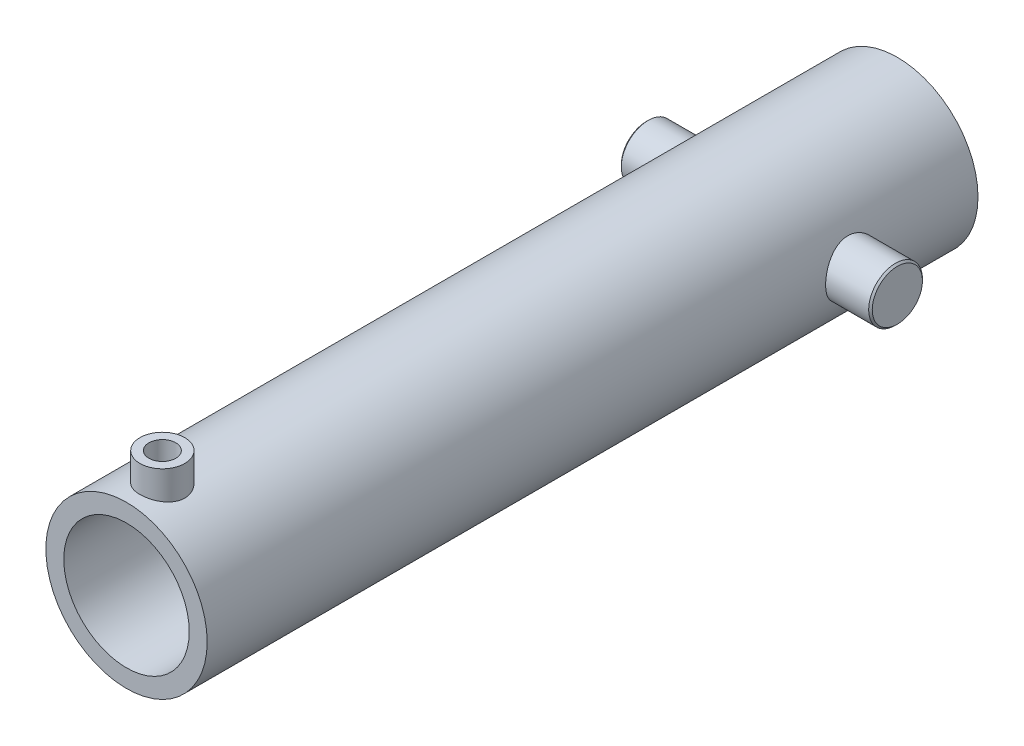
ISO-10303-21;
HEADER;
FILE_DESCRIPTION(('STEP AP214'),'2;1');
FILE_NAME('part.step','',(''),(''),'','','');
FILE_SCHEMA(('AUTOMOTIVE_DESIGN { 1 0 10303 214 1 1 1 1 }'));
ENDSEC;
DATA;
#1=APPLICATION_CONTEXT('core data for automotive mechanical design processes');
#2=APPLICATION_PROTOCOL_DEFINITION('international standard','automotive_design',2000,#1);
#3=PRODUCT_CONTEXT('',#1,'mechanical');
#4=PRODUCT('Part','Part','',(#3));
#5=PRODUCT_RELATED_PRODUCT_CATEGORY('part','',(#4));
#6=PRODUCT_DEFINITION_FORMATION('','',#4);
#7=PRODUCT_DEFINITION_CONTEXT('part definition',#1,'design');
#8=PRODUCT_DEFINITION('design','',#6,#7);
#9=PRODUCT_DEFINITION_SHAPE('','',#8);
#10=(LENGTH_UNIT() NAMED_UNIT(*) SI_UNIT(.MILLI.,.METRE.));
#11=(NAMED_UNIT(*) PLANE_ANGLE_UNIT() SI_UNIT($,.RADIAN.));
#12=(NAMED_UNIT(*) SI_UNIT($,.STERADIAN.) SOLID_ANGLE_UNIT());
#13=UNCERTAINTY_MEASURE_WITH_UNIT(LENGTH_MEASURE(1.E-05),#10,'distance_accuracy_value','');
#14=(GEOMETRIC_REPRESENTATION_CONTEXT(3) GLOBAL_UNCERTAINTY_ASSIGNED_CONTEXT((#13)) GLOBAL_UNIT_ASSIGNED_CONTEXT((#10,
#11,#12)) REPRESENTATION_CONTEXT('',''));
#15=CARTESIAN_POINT('',(0.,0.,0.));
#16=DIRECTION('',(0.,0.,1.));
#17=DIRECTION('',(1.,0.,0.));
#18=AXIS2_PLACEMENT_3D('',#15,#16,#17);
#19=CARTESIAN_POINT('',(-70.,0.,70.0000000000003));
#20=DIRECTION('',(-1.,0.,0.));
#21=DIRECTION('',(0.,0.,-1.));
#22=AXIS2_PLACEMENT_3D('',#19,#20,#21);
#23=PLANE('',#22);
#24=CARTESIAN_POINT('',(-70.,0.,70.0000000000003));
#25=DIRECTION('',(-1.,0.,0.));
#26=DIRECTION('',(0.,0.,-1.));
#27=AXIS2_PLACEMENT_3D('',#24,#25,#26);
#28=CIRCLE('',#27,14.);
#29=CARTESIAN_POINT('',(-70.,0.,84.0000000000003));
#30=VERTEX_POINT('',#29);
#31=EDGE_CURVE('E66',#30,#30,#28,.T.);
#32=ORIENTED_EDGE('',*,*,#31,.T.);
#33=EDGE_LOOP('',(#32));
#34=FACE_BOUND('',#33,.T.);
#35=ADVANCED_FACE('F58',(#34),#23,.T.);
#36=CARTESIAN_POINT('',(45.001,0.,70.0000000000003));
#37=DIRECTION('',(-0.999999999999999,0.,0.));
#38=DIRECTION('',(0.,0.,-1.));
#39=AXIS2_PLACEMENT_3D('',#36,#37,#38);
#40=CYLINDRICAL_SURFACE('',#39,15.);
#41=CARTESIAN_POINT('',(-69.,0.,70.0000000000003));
#42=DIRECTION('',(-1.,0.,0.));
#43=DIRECTION('',(0.,0.,-1.));
#44=AXIS2_PLACEMENT_3D('',#41,#42,#43);
#45=CIRCLE('',#44,15.);
#46=CARTESIAN_POINT('',(-69.,0.,85.0000000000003));
#47=VERTEX_POINT('',#46);
#48=EDGE_CURVE('E12',#47,#47,#45,.F.);
#49=ORIENTED_EDGE('',*,*,#48,.T.);
#50=EDGE_LOOP('',(#49));
#51=FACE_BOUND('',#50,.T.);
#52=CARTESIAN_POINT('',(-45.,0.,55.0000000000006));
#53=CARTESIAN_POINT('',(-45.0000001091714,-0.409226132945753,54.999999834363));
#54=CARTESIAN_POINT('',(-44.9944050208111,-0.818449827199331,55.0167600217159));
#55=CARTESIAN_POINT('',(-44.9721787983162,-1.63385437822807,55.0836379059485));
#56=CARTESIAN_POINT('',(-44.9555477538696,-2.04003525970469,55.1337553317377));
#57=CARTESIAN_POINT('',(-44.9117020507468,-2.84641668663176,55.2668766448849));
#58=CARTESIAN_POINT('',(-44.8844865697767,-3.24661676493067,55.3498830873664));
#59=CARTESIAN_POINT('',(-44.8202062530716,-4.03816775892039,55.5480222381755));
#60=CARTESIAN_POINT('',(-44.7831413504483,-4.42951861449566,55.6631551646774));
#61=CARTESIAN_POINT('',(-44.7002176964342,-5.20004285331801,55.9243203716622));
#62=CARTESIAN_POINT('',(-44.6543741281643,-5.57923596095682,56.0702993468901));
#63=CARTESIAN_POINT('',(-44.5550437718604,-6.32369468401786,56.3920856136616));
#64=CARTESIAN_POINT('',(-44.5015570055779,-6.68896033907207,56.5678928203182));
#65=CARTESIAN_POINT('',(-44.3883065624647,-7.40331254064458,56.9480016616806));
#66=CARTESIAN_POINT('',(-44.3285430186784,-7.75239942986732,57.1523026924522));
#67=CARTESIAN_POINT('',(-44.2042195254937,-8.43246869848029,57.5880448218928));
#68=CARTESIAN_POINT('',(-44.1396578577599,-8.76344451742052,57.8194956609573));
#69=CARTESIAN_POINT('',(-44.0053103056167,-9.41524331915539,58.3155621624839));
#70=CARTESIAN_POINT('',(-43.9354244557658,-9.73543202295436,58.5809844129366));
#71=CARTESIAN_POINT('',(-43.7941310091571,-10.3525021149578,59.1372988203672));
#72=CARTESIAN_POINT('',(-43.7227233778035,-10.6493829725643,59.4281915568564));
#73=CARTESIAN_POINT('',(-43.5802613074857,-11.2181469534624,60.0337672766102));
#74=CARTESIAN_POINT('',(-43.5092070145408,-11.4900204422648,60.3484593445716));
#75=CARTESIAN_POINT('',(-43.3694291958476,-12.006842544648,60.999531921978));
#76=CARTESIAN_POINT('',(-43.3007048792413,-12.2518003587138,61.3359049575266));
#77=CARTESIAN_POINT('',(-43.165536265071,-12.7199675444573,62.0384836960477));
#78=CARTESIAN_POINT('',(-43.0992159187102,-12.9423400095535,62.4052717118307));
#79=CARTESIAN_POINT('',(-42.9730542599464,-13.3552702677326,63.1574261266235));
#80=CARTESIAN_POINT('',(-42.9132131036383,-13.5458272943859,63.5427929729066));
#81=CARTESIAN_POINT('',(-42.8019178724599,-13.8934934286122,64.3294010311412));
#82=CARTESIAN_POINT('',(-42.7504618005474,-14.0506105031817,64.7306384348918));
#83=CARTESIAN_POINT('',(-42.6576173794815,-14.3300168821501,65.546193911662));
#84=CARTESIAN_POINT('',(-42.6162285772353,-14.4523077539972,65.9605113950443));
#85=CARTESIAN_POINT('',(-42.5461344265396,-14.6573459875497,66.7849541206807));
#86=CARTESIAN_POINT('',(-42.5170487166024,-14.7412868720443,67.1947502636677));
#87=CARTESIAN_POINT('',(-42.4705569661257,-14.8747034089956,68.0205742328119));
#88=CARTESIAN_POINT('',(-42.4531506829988,-14.9241797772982,68.4366019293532));
#89=CARTESIAN_POINT('',(-42.4306082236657,-14.9881500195,69.2715590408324));
#90=CARTESIAN_POINT('',(-42.4254687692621,-15.0026532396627,69.6904876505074));
#91=CARTESIAN_POINT('',(-42.4276263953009,-14.9965507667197,70.5280506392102));
#92=CARTESIAN_POINT('',(-42.4349231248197,-14.9759460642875,70.9466850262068));
#93=CARTESIAN_POINT('',(-42.4610878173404,-14.9015928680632,71.76127216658));
#94=CARTESIAN_POINT('',(-42.4794108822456,-14.8494045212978,72.1573860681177));
#95=CARTESIAN_POINT('',(-42.5265873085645,-14.7137528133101,72.9435676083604));
#96=CARTESIAN_POINT('',(-42.5554403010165,-14.6302905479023,73.3336354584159));
#97=CARTESIAN_POINT('',(-42.6228154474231,-14.4328260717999,74.1051313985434));
#98=CARTESIAN_POINT('',(-42.6613384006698,-14.3188213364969,74.4865587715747));
#99=CARTESIAN_POINT('',(-42.7469332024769,-14.0612269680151,75.2382989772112));
#100=CARTESIAN_POINT('',(-42.7940052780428,-13.9176365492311,75.6086115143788));
#101=CARTESIAN_POINT('',(-42.8961929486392,-13.5994478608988,76.3417067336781));
#102=CARTESIAN_POINT('',(-42.9514256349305,-13.4243884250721,76.7042728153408));
#103=CARTESIAN_POINT('',(-43.0678140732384,-13.0461688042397,77.4134323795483));
#104=CARTESIAN_POINT('',(-43.1289698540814,-12.8430084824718,77.760025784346));
#105=CARTESIAN_POINT('',(-43.2555765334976,-12.4099150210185,78.4353394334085));
#106=CARTESIAN_POINT('',(-43.3210284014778,-12.179975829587,78.7640556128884));
#107=CARTESIAN_POINT('',(-43.4545163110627,-11.6947983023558,79.4017132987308));
#108=CARTESIAN_POINT('',(-43.5225524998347,-11.4395585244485,79.7106536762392));
#109=CARTESIAN_POINT('',(-43.6630643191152,-10.8913264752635,80.322618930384));
#110=CARTESIAN_POINT('',(-43.735586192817,-10.597058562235,80.6244916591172));
#111=CARTESIAN_POINT('',(-43.8795893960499,-9.98402514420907,81.202532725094));
#112=CARTESIAN_POINT('',(-43.9510706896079,-9.66525879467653,81.4787001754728));
#113=CARTESIAN_POINT('',(-44.0910538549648,-9.00515377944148,82.003541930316));
#114=CARTESIAN_POINT('',(-44.1595553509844,-8.66381228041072,82.2522127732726));
#115=CARTESIAN_POINT('',(-44.2917000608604,-7.96073030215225,82.7202637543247));
#116=CARTESIAN_POINT('',(-44.3553435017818,-7.59899077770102,82.9396452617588));
#117=CARTESIAN_POINT('',(-44.4766319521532,-6.85369584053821,83.3495134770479));
#118=CARTESIAN_POINT('',(-44.534210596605,-6.46995841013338,83.5396892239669));
#119=CARTESIAN_POINT('',(-44.6409956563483,-5.68662786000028,83.8868929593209));
#120=CARTESIAN_POINT('',(-44.6902019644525,-5.28703453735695,84.0439205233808));
#121=CARTESIAN_POINT('',(-44.7788039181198,-4.47498301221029,84.3233672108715));
#122=CARTESIAN_POINT('',(-44.8182023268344,-4.06252846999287,84.4457960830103));
#123=CARTESIAN_POINT('',(-44.8860419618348,-3.22777718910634,84.6549159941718));
#124=CARTESIAN_POINT('',(-44.9144836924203,-2.80548090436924,84.7416086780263));
#125=CARTESIAN_POINT('',(-44.9585819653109,-1.97284604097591,84.8754124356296));
#126=CARTESIAN_POINT('',(-44.9747394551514,-1.56278306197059,84.9240769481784));
#127=CARTESIAN_POINT('',(-44.9958019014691,-0.739756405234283,84.9874310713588));
#128=CARTESIAN_POINT('',(-45.0007071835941,-0.32679281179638,85.002121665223));
#129=CARTESIAN_POINT('',(-44.9991283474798,0.498852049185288,84.9973849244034));
#130=CARTESIAN_POINT('',(-44.9926459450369,0.911533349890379,84.9779627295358));
#131=CARTESIAN_POINT('',(-44.9684761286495,1.7335593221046,84.9052011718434));
#132=CARTESIAN_POINT('',(-44.9507888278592,2.14290402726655,84.8518621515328));
#133=CARTESIAN_POINT('',(-44.9053711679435,2.94341568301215,84.7138188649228));
#134=CARTESIAN_POINT('',(-44.8779472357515,3.33476537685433,84.630069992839));
#135=CARTESIAN_POINT('',(-44.8137104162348,4.10879208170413,84.4318200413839));
#136=CARTESIAN_POINT('',(-44.7768977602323,4.49146930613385,84.3173197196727));
#137=CARTESIAN_POINT('',(-44.6948160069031,5.24569843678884,84.0585073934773));
#138=CARTESIAN_POINT('',(-44.6495461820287,5.61724938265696,83.91419282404));
#139=CARTESIAN_POINT('',(-44.5516829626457,6.34689367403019,83.5968827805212));
#140=CARTESIAN_POINT('',(-44.4990893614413,6.70498663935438,83.4238864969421));
#141=CARTESIAN_POINT('',(-44.3864077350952,7.41480419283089,83.0455603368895));
#142=CARTESIAN_POINT('',(-44.3261590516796,7.76611395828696,82.8395000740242));
#143=CARTESIAN_POINT('',(-44.200844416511,8.45022523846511,82.3999599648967));
#144=CARTESIAN_POINT('',(-44.1357784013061,8.78302650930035,82.1664797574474));
#145=CARTESIAN_POINT('',(-44.002469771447,9.42821202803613,81.6736291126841));
#146=CARTESIAN_POINT('',(-43.9342270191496,9.7405953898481,81.4142575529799));
#147=CARTESIAN_POINT('',(-43.7962569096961,10.3432834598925,80.8711145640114));
#148=CARTESIAN_POINT('',(-43.7265288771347,10.6335778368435,80.5873318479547));
#149=CARTESIAN_POINT('',(-43.5842208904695,11.2029316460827,79.9836961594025));
#150=CARTESIAN_POINT('',(-43.5116555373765,11.480878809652,79.6627894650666));
#151=CARTESIAN_POINT('',(-43.368950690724,12.0086989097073,78.9983932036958));
#152=CARTESIAN_POINT('',(-43.2988101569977,12.2585839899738,78.6549135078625));
#153=CARTESIAN_POINT('',(-43.1629327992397,12.7287529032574,77.9472849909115));
#154=CARTESIAN_POINT('',(-43.0971971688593,12.9490287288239,77.583130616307));
#155=CARTESIAN_POINT('',(-42.972121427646,13.3582401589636,76.8365643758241));
#156=CARTESIAN_POINT('',(-42.9127812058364,13.5471763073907,76.4541528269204));
#157=CARTESIAN_POINT('',(-42.8024529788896,13.8918220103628,75.6743826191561));
#158=CARTESIAN_POINT('',(-42.7514486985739,14.0475964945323,75.277054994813));
#159=CARTESIAN_POINT('',(-42.6592989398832,14.3249992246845,74.4695245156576));
#160=CARTESIAN_POINT('',(-42.6181534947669,14.4466273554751,74.0593216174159));
#161=CARTESIAN_POINT('',(-42.5471168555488,14.6545191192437,73.2292498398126));
#162=CARTESIAN_POINT('',(-42.5172214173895,14.740796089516,72.8093846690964));
#163=CARTESIAN_POINT('',(-42.469700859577,14.8771552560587,71.9631364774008));
#164=CARTESIAN_POINT('',(-42.4520751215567,14.9272392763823,71.5367537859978));
#165=CARTESIAN_POINT('',(-42.4302893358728,14.9890474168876,70.7029504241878));
#166=CARTESIAN_POINT('',(-42.4254835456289,15.0026114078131,70.2956819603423));
#167=CARTESIAN_POINT('',(-42.4276229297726,14.9965606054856,69.4814312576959));
#168=CARTESIAN_POINT('',(-42.4345676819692,14.9769470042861,69.0744490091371));
#169=CARTESIAN_POINT('',(-42.4599835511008,14.9047392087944,68.2638167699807));
#170=CARTESIAN_POINT('',(-42.4784539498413,14.8521470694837,67.8601665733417));
#171=CARTESIAN_POINT('',(-42.526332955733,14.7144929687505,67.0591054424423));
#172=CARTESIAN_POINT('',(-42.5557415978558,14.6294309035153,66.6616945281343));
#173=CARTESIAN_POINT('',(-42.623925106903,14.4295502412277,65.8833960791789));
#174=CARTESIAN_POINT('',(-42.6625107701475,14.3153297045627,65.5023379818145));
#175=CARTESIAN_POINT('',(-42.7482055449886,14.0573603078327,64.7513570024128));
#176=CARTESIAN_POINT('',(-42.7953144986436,13.913611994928,64.3814339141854));
#177=CARTESIAN_POINT('',(-42.8967378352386,13.5976978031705,63.6549615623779));
#178=CARTESIAN_POINT('',(-42.9510522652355,13.4255317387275,63.2984123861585));
#179=CARTESIAN_POINT('',(-43.0654415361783,13.0539469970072,62.6006228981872));
#180=CARTESIAN_POINT('',(-43.1255184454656,12.8545185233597,62.2593881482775));
#181=CARTESIAN_POINT('',(-43.2525591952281,12.4205243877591,61.5797795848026));
#182=CARTESIAN_POINT('',(-43.3197088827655,12.1848082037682,61.2421748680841));
#183=CARTESIAN_POINT('',(-43.4567250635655,11.6867336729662,60.5878089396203));
#184=CARTESIAN_POINT('',(-43.5265916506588,11.4243744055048,60.2710484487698));
#185=CARTESIAN_POINT('',(-43.6672084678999,10.8745318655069,59.6601005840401));
#186=CARTESIAN_POINT('',(-43.737959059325,10.5870380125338,59.3659228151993));
#187=CARTESIAN_POINT('',(-43.8784391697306,9.98884013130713,58.8021455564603));
#188=CARTESIAN_POINT('',(-43.94816901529,9.6781437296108,58.5325380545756));
#189=CARTESIAN_POINT('',(-44.0875071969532,9.02265511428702,58.0094061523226));
#190=CARTESIAN_POINT('',(-44.1570035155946,8.67700359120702,57.7569271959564));
#191=CARTESIAN_POINT('',(-44.2910251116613,7.96469800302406,57.2820277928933));
#192=CARTESIAN_POINT('',(-44.3555502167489,7.59804321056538,57.0596083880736));
#193=CARTESIAN_POINT('',(-44.4777947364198,6.8462229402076,56.6466057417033));
#194=CARTESIAN_POINT('',(-44.5355155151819,6.46106119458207,56.4560161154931));
#195=CARTESIAN_POINT('',(-44.6425111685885,5.67481771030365,56.1082326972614));
#196=CARTESIAN_POINT('',(-44.6917864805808,5.27373679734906,55.9510371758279));
#197=CARTESIAN_POINT('',(-44.7784759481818,4.47677474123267,55.6777116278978));
#198=CARTESIAN_POINT('',(-44.8163216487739,4.0814617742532,55.5600607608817));
#199=CARTESIAN_POINT('',(-44.8819717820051,3.28170029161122,55.3575761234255));
#200=CARTESIAN_POINT('',(-44.9097765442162,2.87725207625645,55.2727412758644));
#201=CARTESIAN_POINT('',(-44.9545735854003,2.06223938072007,55.1366956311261));
#202=CARTESIAN_POINT('',(-44.9715683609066,1.65167633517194,55.0854770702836));
#203=CARTESIAN_POINT('',(-44.9942814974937,0.827408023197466,55.0171293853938));
#204=CARTESIAN_POINT('',(-44.9999998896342,0.413702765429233,55.0000001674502));
#205=CARTESIAN_POINT('',(-45.,0.,55.0000000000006));
#206=B_SPLINE_CURVE_WITH_KNOTS('',3,(#52,#53,#54,#55,#56,#57,#58,#59,#60,#61,#62,#63,#64,#65,
#66,#67,#68,#69,#70,#71,#72,#73,#74,#75,#76,#77,#78,#79,#80,#81,#82,#83,#84,#85,#86,#87,#88,#89,
#90,#91,#92,#93,#94,#95,#96,#97,#98,#99,#100,#101,#102,#103,#104,#105,#106,#107,#108,#109,#110,
#111,#112,#113,#114,#115,#116,#117,#118,#119,#120,#121,#122,#123,#124,#125,#126,#127,#128,#129,
#130,#131,#132,#133,#134,#135,#136,#137,#138,#139,#140,#141,#142,#143,#144,#145,#146,#147,#148,
#149,#150,#151,#152,#153,#154,#155,#156,#157,#158,#159,#160,#161,#162,#163,#164,#165,#166,#167,
#168,#169,#170,#171,#172,#173,#174,#175,#176,#177,#178,#179,#180,#181,#182,#183,#184,#185,#186,
#187,#188,#189,#190,#191,#192,#193,#194,#195,#196,#197,#198,#199,#200,#201,#202,#203,#204,#205),
.UNSPECIFIED.,.T.,.F.,(4,2,2,2,2,2,2,2,2,2,2,2,2,2,2,2,2,2,2,2,2,2,2,2,2,2,2,2,2,2,2,2,2,2,2,2,
2,2,2,2,2,2,2,2,2,2,2,2,2,2,2,2,2,2,2,2,2,2,2,2,2,2,2,2,2,2,2,2,2,2,2,2,2,2,2,2,4),(0.,
1.22729464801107,2.45457932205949,3.68195936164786,4.90934773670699,6.13463215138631,
7.35991307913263,8.5851680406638,9.81086393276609,11.0746152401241,12.3383953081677,
13.6026602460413,14.8664916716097,16.1669809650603,17.4675015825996,18.7677120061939,
20.0678639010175,21.324209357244,22.5805287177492,23.8365123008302,25.092460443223,
26.29092415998,27.4893458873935,28.6878667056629,29.886419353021,31.1042305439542,
32.32204766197,33.540140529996,34.7583028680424,36.0401025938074,37.3219465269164,
38.60395164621,39.8858968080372,41.1806643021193,42.4754483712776,43.7698672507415,
45.0642265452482,46.3024555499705,47.5406487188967,48.7786553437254,50.0166494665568,
51.2187078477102,52.4207366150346,53.6228688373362,54.8250349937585,56.0588011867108,
57.2925836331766,58.5264195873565,59.7608291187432,61.0514074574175,62.3414251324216,
63.6317909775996,64.9221344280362,66.2099276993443,67.497725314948,68.7850366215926,
70.0722830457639,71.2933459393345,72.5143649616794,73.7353079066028,74.9562547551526,
76.1539303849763,77.3515838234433,78.5492450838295,79.7473378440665,80.9975087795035,
82.2477229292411,83.4984659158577,84.748799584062,86.0481697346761,87.3475849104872,
88.6467391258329,89.9458260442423,91.1868772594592,92.4278877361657,93.6686115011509,
94.9093318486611),.UNSPECIFIED.);
#207=CARTESIAN_POINT('',(-45.,0.,55.0000000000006));
#208=VERTEX_POINT('',#207);
#209=EDGE_CURVE('E70',#208,#208,#206,.T.);
#210=ORIENTED_EDGE('',*,*,#209,.T.);
#211=EDGE_LOOP('',(#210));
#212=FACE_BOUND('',#211,.T.);
#213=ADVANCED_FACE('F60',(#51,#212),#40,.T.);
#214=CARTESIAN_POINT('',(0.,0.,430.));
#215=DIRECTION('',(0.,0.,-1.));
#216=DIRECTION('',(1.,0.,0.));
#217=AXIS2_PLACEMENT_3D('',#214,#215,#216);
#218=CYLINDRICAL_SURFACE('',#217,45.);
#219=ORIENTED_EDGE('',*,*,#209,.F.);
#220=EDGE_LOOP('',(#219));
#221=FACE_BOUND('',#220,.T.);
#222=ADVANCED_FACE('F78',(#221),#218,.F.);
#223=CARTESIAN_POINT('',(-70.,0.,70.0000000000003));
#224=DIRECTION('',(1.,0.,0.));
#225=DIRECTION('',(0.,0.,1.));
#226=AXIS2_PLACEMENT_3D('',#223,#224,#225);
#227=CONICAL_SURFACE('',#226,14.,0.785398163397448);
#228=CARTESIAN_POINT('',(-69.,0.,85.0000000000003));
#229=CARTESIAN_POINT('',(-69.0104166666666,0.,84.9895833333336));
#230=CARTESIAN_POINT('',(-69.0208333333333,0.,84.9791666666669));
#231=CARTESIAN_POINT('',(-69.0416666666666,0.,84.9583333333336));
#232=CARTESIAN_POINT('',(-69.0520833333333,0.,84.9479166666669));
#233=CARTESIAN_POINT('',(-69.0729166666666,0.,84.9270833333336));
#234=CARTESIAN_POINT('',(-69.0833333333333,0.,84.9166666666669));
#235=CARTESIAN_POINT('',(-69.1041666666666,0.,84.8958333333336));
#236=CARTESIAN_POINT('',(-69.1145833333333,0.,84.8854166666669));
#237=CARTESIAN_POINT('',(-69.1354166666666,0.,84.8645833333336));
#238=CARTESIAN_POINT('',(-69.1458333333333,0.,84.8541666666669));
#239=CARTESIAN_POINT('',(-69.1666666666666,0.,84.8333333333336));
#240=CARTESIAN_POINT('',(-69.1770833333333,0.,84.8229166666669));
#241=CARTESIAN_POINT('',(-69.1979166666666,0.,84.8020833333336));
#242=CARTESIAN_POINT('',(-69.2083333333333,0.,84.7916666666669));
#243=CARTESIAN_POINT('',(-69.2291666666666,0.,84.7708333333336));
#244=CARTESIAN_POINT('',(-69.2395833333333,0.,84.7604166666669));
#245=CARTESIAN_POINT('',(-69.2604166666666,0.,84.7395833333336));
#246=CARTESIAN_POINT('',(-69.2708333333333,0.,84.7291666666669));
#247=CARTESIAN_POINT('',(-69.2916666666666,0.,84.7083333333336));
#248=CARTESIAN_POINT('',(-69.3020833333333,0.,84.6979166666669));
#249=CARTESIAN_POINT('',(-69.3229166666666,0.,84.6770833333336));
#250=CARTESIAN_POINT('',(-69.3333333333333,0.,84.6666666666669));
#251=CARTESIAN_POINT('',(-69.3541666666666,0.,84.6458333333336));
#252=CARTESIAN_POINT('',(-69.3645833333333,0.,84.6354166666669));
#253=CARTESIAN_POINT('',(-69.3854166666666,0.,84.6145833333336));
#254=CARTESIAN_POINT('',(-69.3958333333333,0.,84.6041666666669));
#255=CARTESIAN_POINT('',(-69.4166666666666,0.,84.5833333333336));
#256=CARTESIAN_POINT('',(-69.4270833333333,0.,84.5729166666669));
#257=CARTESIAN_POINT('',(-69.4479166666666,0.,84.5520833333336));
#258=CARTESIAN_POINT('',(-69.4583333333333,0.,84.5416666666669));
#259=CARTESIAN_POINT('',(-69.4791666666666,0.,84.5208333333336));
#260=CARTESIAN_POINT('',(-69.4895833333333,0.,84.5104166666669));
#261=CARTESIAN_POINT('',(-69.5104166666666,0.,84.4895833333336));
#262=CARTESIAN_POINT('',(-69.5208333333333,0.,84.4791666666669));
#263=CARTESIAN_POINT('',(-69.5416666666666,0.,84.4583333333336));
#264=CARTESIAN_POINT('',(-69.5520833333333,0.,84.4479166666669));
#265=CARTESIAN_POINT('',(-69.5729166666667,0.,84.4270833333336));
#266=CARTESIAN_POINT('',(-69.5833333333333,0.,84.4166666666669));
#267=CARTESIAN_POINT('',(-69.6041666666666,0.,84.3958333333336));
#268=CARTESIAN_POINT('',(-69.6145833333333,0.,84.3854166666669));
#269=CARTESIAN_POINT('',(-69.6354166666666,0.,84.3645833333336));
#270=CARTESIAN_POINT('',(-69.6458333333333,0.,84.3541666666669));
#271=CARTESIAN_POINT('',(-69.6666666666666,0.,84.3333333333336));
#272=CARTESIAN_POINT('',(-69.6770833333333,0.,84.3229166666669));
#273=CARTESIAN_POINT('',(-69.6979166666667,0.,84.3020833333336));
#274=CARTESIAN_POINT('',(-69.7083333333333,0.,84.2916666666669));
#275=CARTESIAN_POINT('',(-69.7291666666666,0.,84.2708333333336));
#276=CARTESIAN_POINT('',(-69.7395833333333,0.,84.2604166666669));
#277=CARTESIAN_POINT('',(-69.7604166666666,0.,84.2395833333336));
#278=CARTESIAN_POINT('',(-69.7708333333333,0.,84.2291666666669));
#279=CARTESIAN_POINT('',(-69.7916666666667,0.,84.2083333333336));
#280=CARTESIAN_POINT('',(-69.8020833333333,0.,84.1979166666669));
#281=CARTESIAN_POINT('',(-69.8229166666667,0.,84.1770833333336));
#282=CARTESIAN_POINT('',(-69.8333333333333,0.,84.1666666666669));
#283=CARTESIAN_POINT('',(-69.8541666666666,0.,84.1458333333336));
#284=CARTESIAN_POINT('',(-69.8645833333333,0.,84.1354166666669));
#285=CARTESIAN_POINT('',(-69.8854166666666,0.,84.1145833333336));
#286=CARTESIAN_POINT('',(-69.8958333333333,0.,84.1041666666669));
#287=CARTESIAN_POINT('',(-69.9166666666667,0.,84.0833333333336));
#288=CARTESIAN_POINT('',(-69.9270833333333,0.,84.0729166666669));
#289=CARTESIAN_POINT('',(-69.9479166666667,0.,84.0520833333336));
#290=CARTESIAN_POINT('',(-69.9583333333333,0.,84.0416666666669));
#291=CARTESIAN_POINT('',(-69.9791666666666,0.,84.0208333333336));
#292=CARTESIAN_POINT('',(-69.9895833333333,0.,84.0104166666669));
#293=CARTESIAN_POINT('',(-70.,0.,84.0000000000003));
#294=B_SPLINE_CURVE_WITH_KNOTS('',3,(#228,#229,#230,#231,#232,#233,#234,#235,#236,#237,#238,
#239,#240,#241,#242,#243,#244,#245,#246,#247,#248,#249,#250,#251,#252,#253,#254,#255,#256,#257,
#258,#259,#260,#261,#262,#263,#264,#265,#266,#267,#268,#269,#270,#271,#272,#273,#274,#275,#276,
#277,#278,#279,#280,#281,#282,#283,#284,#285,#286,#287,#288,#289,#290,#291,#292,#293),
.UNSPECIFIED.,.F.,.F.,(4,2,2,2,2,2,2,2,2,2,2,2,2,2,2,2,2,2,2,2,2,2,2,2,2,2,2,2,2,2,2,2,4),(0.,
0.0441941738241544,0.0883883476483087,0.132582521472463,0.176776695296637,0.220970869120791,
0.265165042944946,0.3093592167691,0.353553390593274,0.397747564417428,0.441941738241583,
0.486135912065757,0.530330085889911,0.574524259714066,0.61871843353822,0.662912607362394,
0.707106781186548,0.751300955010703,0.795495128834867,0.839689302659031,0.883883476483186,
0.92807765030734,0.972271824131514,1.01646599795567,1.06066017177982,1.104854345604,
1.14904851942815,1.19324269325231,1.23743686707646,1.28163104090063,1.32582521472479,
1.37001938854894,1.4142135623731),.UNSPECIFIED.);
#295=EDGE_CURVE('BSEAM82',#47,#30,#294,.T.);
#296=ORIENTED_EDGE('',*,*,#48,.F.);
#297=ORIENTED_EDGE('',*,*,#31,.F.);
#298=ORIENTED_EDGE('',*,*,#295,.T.);
#299=ORIENTED_EDGE('',*,*,#295,.F.);
#300=EDGE_LOOP('',(#296,#298,#297,#299));
#301=FACE_BOUND('',#300,.T.);
#302=ADVANCED_FACE('F82',(#301),#227,.T.);
#303=CLOSED_SHELL('',(#35,#213,#222,#302));
#304=MANIFOLD_SOLID_BREP('B2',#303);
#305=CARTESIAN_POINT('',(70.,0.,69.9999999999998));
#306=DIRECTION('',(1.,0.,0.));
#307=DIRECTION('',(0.,0.,-1.));
#308=AXIS2_PLACEMENT_3D('',#305,#306,#307);
#309=PLANE('',#308);
#310=CARTESIAN_POINT('',(70.,0.,69.9999999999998));
#311=DIRECTION('',(1.,0.,0.));
#312=DIRECTION('',(0.,0.,-1.));
#313=AXIS2_PLACEMENT_3D('',#310,#311,#312);
#314=CIRCLE('',#313,14.);
#315=CARTESIAN_POINT('',(70.,0.,83.9999999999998));
#316=VERTEX_POINT('',#315);
#317=EDGE_CURVE('E133',#316,#316,#314,.T.);
#318=ORIENTED_EDGE('',*,*,#317,.T.);
#319=EDGE_LOOP('',(#318));
#320=FACE_BOUND('',#319,.T.);
#321=ADVANCED_FACE('F125',(#320),#309,.T.);
#322=CARTESIAN_POINT('',(-45.001,0.,70.0000000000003));
#323=DIRECTION('',(0.999999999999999,0.,0.));
#324=DIRECTION('',(0.,0.,-1.));
#325=AXIS2_PLACEMENT_3D('',#322,#323,#324);
#326=CYLINDRICAL_SURFACE('',#325,15.);
#327=CARTESIAN_POINT('',(68.9999999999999,0.,69.9999999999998));
#328=DIRECTION('',(1.,0.,0.));
#329=DIRECTION('',(0.,0.,-1.));
#330=AXIS2_PLACEMENT_3D('',#327,#328,#329);
#331=CIRCLE('',#330,15.);
#332=CARTESIAN_POINT('',(68.9999999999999,0.,84.9999999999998));
#333=VERTEX_POINT('',#332);
#334=EDGE_CURVE('E57',#333,#333,#331,.F.);
#335=ORIENTED_EDGE('',*,*,#334,.T.);
#336=EDGE_LOOP('',(#335));
#337=FACE_BOUND('',#336,.T.);
#338=CARTESIAN_POINT('',(45.,0.,55.0000000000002));
#339=CARTESIAN_POINT('',(45.0000001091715,0.409226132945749,54.9999998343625));
#340=CARTESIAN_POINT('',(44.9944050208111,0.818449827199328,55.0167600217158));
#341=CARTESIAN_POINT('',(44.9721787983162,1.63385437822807,55.0836379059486));
#342=CARTESIAN_POINT('',(44.9555477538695,2.04003525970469,55.1337553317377));
#343=CARTESIAN_POINT('',(44.9117020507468,2.84641668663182,55.2668766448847));
#344=CARTESIAN_POINT('',(44.8844865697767,3.24661676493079,55.3498830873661));
#345=CARTESIAN_POINT('',(44.8202062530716,4.03816775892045,55.5480222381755));
#346=CARTESIAN_POINT('',(44.7831413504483,4.42951861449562,55.6631551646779));
#347=CARTESIAN_POINT('',(44.7002176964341,5.20004285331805,55.9243203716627));
#348=CARTESIAN_POINT('',(44.6543741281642,5.57923596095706,56.0702993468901));
#349=CARTESIAN_POINT('',(44.5550437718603,6.32369468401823,56.3920856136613));
#350=CARTESIAN_POINT('',(44.5015570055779,6.68896033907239,56.567892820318));
#351=CARTESIAN_POINT('',(44.3883065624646,7.40331254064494,56.9480016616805));
#352=CARTESIAN_POINT('',(44.3285430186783,7.75239942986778,57.1523026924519));
#353=CARTESIAN_POINT('',(44.2042195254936,8.43246869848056,57.5880448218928));
#354=CARTESIAN_POINT('',(44.1396578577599,8.76344451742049,57.8194956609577));
#355=CARTESIAN_POINT('',(44.0053103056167,9.41524331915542,58.3155621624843));
#356=CARTESIAN_POINT('',(43.9354244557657,9.73543202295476,58.5809844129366));
#357=CARTESIAN_POINT('',(43.794131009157,10.3525021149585,59.1372988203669));
#358=CARTESIAN_POINT('',(43.7227233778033,10.6493829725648,59.4281915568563));
#359=CARTESIAN_POINT('',(43.5802613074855,11.2181469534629,60.0337672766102));
#360=CARTESIAN_POINT('',(43.5092070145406,11.4900204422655,60.3484593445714));
#361=CARTESIAN_POINT('',(43.3694291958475,12.0068425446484,60.9995319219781));
#362=CARTESIAN_POINT('',(43.3007048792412,12.2518003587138,61.335904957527));
#363=CARTESIAN_POINT('',(43.1655362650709,12.7199675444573,62.0384836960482));
#364=CARTESIAN_POINT('',(43.09921591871,12.942340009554,62.405271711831));
#365=CARTESIAN_POINT('',(42.9730542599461,13.3552702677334,63.1574261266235));
#366=CARTESIAN_POINT('',(42.9132131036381,13.5458272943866,63.5427929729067));
#367=CARTESIAN_POINT('',(42.8019178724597,13.8934934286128,64.3294010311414));
#368=CARTESIAN_POINT('',(42.7504618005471,14.0506105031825,64.7306384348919));
#369=CARTESIAN_POINT('',(42.6576173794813,14.3300168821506,65.5461939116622));
#370=CARTESIAN_POINT('',(42.6162285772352,14.4523077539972,65.9605113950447));
#371=CARTESIAN_POINT('',(42.5461344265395,14.6573459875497,66.7849541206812));
#372=CARTESIAN_POINT('',(42.5170487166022,14.7412868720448,67.1947502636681));
#373=CARTESIAN_POINT('',(42.4705569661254,14.8747034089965,68.0205742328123));
#374=CARTESIAN_POINT('',(42.4531506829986,14.9241797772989,68.4366019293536));
#375=CARTESIAN_POINT('',(42.4306082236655,14.9881500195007,69.2715590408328));
#376=CARTESIAN_POINT('',(42.4254687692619,15.0026532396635,69.6904876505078));
#377=CARTESIAN_POINT('',(42.4276263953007,14.9965507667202,70.5280506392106));
#378=CARTESIAN_POINT('',(42.4349231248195,14.9759460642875,70.9466850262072));
#379=CARTESIAN_POINT('',(42.4610878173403,14.9015928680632,71.7612721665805));
#380=CARTESIAN_POINT('',(42.4794108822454,14.8494045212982,72.1573860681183));
#381=CARTESIAN_POINT('',(42.5265873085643,14.7137528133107,72.9435676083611));
#382=CARTESIAN_POINT('',(42.5554403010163,14.6302905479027,73.3336354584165));
#383=CARTESIAN_POINT('',(42.6228154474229,14.4328260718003,74.105131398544));
#384=CARTESIAN_POINT('',(42.6613384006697,14.3188213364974,74.4865587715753));
#385=CARTESIAN_POINT('',(42.7469332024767,14.0612269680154,75.2382989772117));
#386=CARTESIAN_POINT('',(42.7940052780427,13.9176365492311,75.6086115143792));
#387=CARTESIAN_POINT('',(42.8961929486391,13.5994478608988,76.3417067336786));
#388=CARTESIAN_POINT('',(42.9514256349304,13.4243884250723,76.7042728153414));
#389=CARTESIAN_POINT('',(43.0678140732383,13.0461688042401,77.4134323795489));
#390=CARTESIAN_POINT('',(43.1289698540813,12.8430084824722,77.7600257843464));
#391=CARTESIAN_POINT('',(43.2555765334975,12.4099150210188,78.4353394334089));
#392=CARTESIAN_POINT('',(43.3210284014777,12.1799758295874,78.7640556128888));
#393=CARTESIAN_POINT('',(43.4545163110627,11.6947983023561,79.4017132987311));
#394=CARTESIAN_POINT('',(43.5225524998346,11.4395585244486,79.7106536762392));
#395=CARTESIAN_POINT('',(43.6630643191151,10.8913264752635,80.322618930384));
#396=CARTESIAN_POINT('',(43.735586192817,10.5970585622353,80.6244916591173));
#397=CARTESIAN_POINT('',(43.8795893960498,9.98402514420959,81.2025327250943));
#398=CARTESIAN_POINT('',(43.9510706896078,9.66525879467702,81.478700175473));
#399=CARTESIAN_POINT('',(44.0910538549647,9.00515377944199,82.003541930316));
#400=CARTESIAN_POINT('',(44.1595553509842,8.66381228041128,82.2522127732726));
#401=CARTESIAN_POINT('',(44.2917000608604,7.96073030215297,82.7202637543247));
#402=CARTESIAN_POINT('',(44.3553435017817,7.59899077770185,82.9396452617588));
#403=CARTESIAN_POINT('',(44.4766319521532,6.85369584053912,83.3495134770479));
#404=CARTESIAN_POINT('',(44.5342105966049,6.46995841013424,83.5396892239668));
#405=CARTESIAN_POINT('',(44.6409956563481,5.68662786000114,83.8868929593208));
#406=CARTESIAN_POINT('',(44.6902019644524,5.28703453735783,84.0439205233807));
#407=CARTESIAN_POINT('',(44.7788039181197,4.47498301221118,84.3233672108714));
#408=CARTESIAN_POINT('',(44.8182023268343,4.06252846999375,84.4457960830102));
#409=CARTESIAN_POINT('',(44.8860419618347,3.22777718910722,84.6549159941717));
#410=CARTESIAN_POINT('',(44.9144836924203,2.80548090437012,84.7416086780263));
#411=CARTESIAN_POINT('',(44.9585819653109,1.97284604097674,84.8754124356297));
#412=CARTESIAN_POINT('',(44.9747394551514,1.56278306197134,84.9240769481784));
#413=CARTESIAN_POINT('',(44.995801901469,0.739756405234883,84.9874310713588));
#414=CARTESIAN_POINT('',(45.0007071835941,0.326792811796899,85.002121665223));
#415=CARTESIAN_POINT('',(44.9991283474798,-0.498852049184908,84.9973849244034));
#416=CARTESIAN_POINT('',(44.9926459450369,-0.911533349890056,84.9779627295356));
#417=CARTESIAN_POINT('',(44.9684761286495,-1.73355932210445,84.9052011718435));
#418=CARTESIAN_POINT('',(44.9507888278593,-2.14290402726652,84.8518621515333));
#419=CARTESIAN_POINT('',(44.9053711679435,-2.94341568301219,84.7138188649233));
#420=CARTESIAN_POINT('',(44.8779472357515,-3.33476537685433,84.630069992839));
#421=CARTESIAN_POINT('',(44.8137104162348,-4.10879208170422,84.4318200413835));
#422=CARTESIAN_POINT('',(44.7768977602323,-4.49146930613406,84.3173197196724));
#423=CARTESIAN_POINT('',(44.6948160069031,-5.24569843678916,84.058507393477));
#424=CARTESIAN_POINT('',(44.6495461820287,-5.61724938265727,83.9141928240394));
#425=CARTESIAN_POINT('',(44.5516829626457,-6.34689367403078,83.5968827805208));
#426=CARTESIAN_POINT('',(44.4990893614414,-6.70498663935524,83.4238864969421));
#427=CARTESIAN_POINT('',(44.3864077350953,-7.41480419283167,83.0455603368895));
#428=CARTESIAN_POINT('',(44.3261590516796,-7.76611395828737,82.8395000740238));
#429=CARTESIAN_POINT('',(44.2008444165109,-8.45022523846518,82.399959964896));
#430=CARTESIAN_POINT('',(44.1357784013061,-8.78302650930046,82.1664797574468));
#431=CARTESIAN_POINT('',(44.002469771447,-9.42821202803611,81.6736291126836));
#432=CARTESIAN_POINT('',(43.9342270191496,-9.74059538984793,81.4142575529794));
#433=CARTESIAN_POINT('',(43.7962569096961,-10.3432834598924,80.871114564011));
#434=CARTESIAN_POINT('',(43.7265288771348,-10.6335778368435,80.5873318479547));
#435=CARTESIAN_POINT('',(43.5842208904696,-11.2029316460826,79.9836961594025));
#436=CARTESIAN_POINT('',(43.5116555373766,-11.4808788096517,79.6627894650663));
#437=CARTESIAN_POINT('',(43.3689506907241,-12.0086989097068,78.9983932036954));
#438=CARTESIAN_POINT('',(43.2988101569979,-12.2585839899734,78.6549135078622));
#439=CARTESIAN_POINT('',(43.1629327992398,-12.728752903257,77.9472849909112));
#440=CARTESIAN_POINT('',(43.0971971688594,-12.9490287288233,77.5831306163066));
#441=CARTESIAN_POINT('',(42.9721214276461,-13.3582401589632,76.8365643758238));
#442=CARTESIAN_POINT('',(42.9127812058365,-13.5471763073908,76.4541528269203));
#443=CARTESIAN_POINT('',(42.8024529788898,-13.8918220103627,75.6743826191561));
#444=CARTESIAN_POINT('',(42.751448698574,-14.0475964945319,75.2770549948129));
#445=CARTESIAN_POINT('',(42.6592989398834,-14.3249992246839,74.4695245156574));
#446=CARTESIAN_POINT('',(42.6181534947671,-14.4466273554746,74.0593216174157));
#447=CARTESIAN_POINT('',(42.547116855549,-14.6545191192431,73.2292498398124));
#448=CARTESIAN_POINT('',(42.5172214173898,-14.7407960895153,72.8093846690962));
#449=CARTESIAN_POINT('',(42.4697008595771,-14.8771552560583,71.9631364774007));
#450=CARTESIAN_POINT('',(42.4520751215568,-14.9272392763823,71.5367537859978));
#451=CARTESIAN_POINT('',(42.430289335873,-14.9890474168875,70.7029504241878));
#452=CARTESIAN_POINT('',(42.4254835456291,-15.0026114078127,70.2956819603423));
#453=CARTESIAN_POINT('',(42.4276229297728,-14.9965606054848,69.4814312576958));
#454=CARTESIAN_POINT('',(42.4345676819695,-14.9769470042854,69.074449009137));
#455=CARTESIAN_POINT('',(42.459983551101,-14.9047392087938,68.2638167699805));
#456=CARTESIAN_POINT('',(42.4784539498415,-14.8521470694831,67.8601665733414));
#457=CARTESIAN_POINT('',(42.5263329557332,-14.7144929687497,67.0591054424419));
#458=CARTESIAN_POINT('',(42.5557415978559,-14.6294309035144,66.6616945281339));
#459=CARTESIAN_POINT('',(42.6239251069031,-14.4295502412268,65.8833960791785));
#460=CARTESIAN_POINT('',(42.6625107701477,-14.3153297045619,65.5023379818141));
#461=CARTESIAN_POINT('',(42.7482055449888,-14.0573603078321,64.7513570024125));
#462=CARTESIAN_POINT('',(42.7953144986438,-13.9136119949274,64.3814339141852));
#463=CARTESIAN_POINT('',(42.8967378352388,-13.5976978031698,63.6549615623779));
#464=CARTESIAN_POINT('',(42.9510522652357,-13.4255317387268,63.2984123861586));
#465=CARTESIAN_POINT('',(43.0654415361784,-13.0539469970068,62.6006228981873));
#466=CARTESIAN_POINT('',(43.1255184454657,-12.8545185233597,62.2593881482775));
#467=CARTESIAN_POINT('',(43.2525591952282,-12.4205243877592,61.5797795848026));
#468=CARTESIAN_POINT('',(43.3197088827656,-12.1848082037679,61.2421748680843));
#469=CARTESIAN_POINT('',(43.4567250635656,-11.6867336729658,60.5878089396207));
#470=CARTESIAN_POINT('',(43.5265916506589,-11.4243744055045,60.2710484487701));
#471=CARTESIAN_POINT('',(43.6672084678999,-10.8745318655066,59.6601005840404));
#472=CARTESIAN_POINT('',(43.7379590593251,-10.5870380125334,59.3659228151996));
#473=CARTESIAN_POINT('',(43.8784391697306,-9.98884013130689,58.8021455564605));
#474=CARTESIAN_POINT('',(43.9481690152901,-9.67814372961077,58.5325380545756));
#475=CARTESIAN_POINT('',(44.0875071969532,-9.02265511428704,58.0094061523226));
#476=CARTESIAN_POINT('',(44.1570035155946,-8.67700359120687,57.7569271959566));
#477=CARTESIAN_POINT('',(44.2910251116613,-7.96469800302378,57.2820277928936));
#478=CARTESIAN_POINT('',(44.3555502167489,-7.59804321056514,57.0596083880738));
#479=CARTESIAN_POINT('',(44.4777947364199,-6.84622294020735,56.6466057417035));
#480=CARTESIAN_POINT('',(44.535515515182,-6.46106119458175,56.4560161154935));
#481=CARTESIAN_POINT('',(44.6425111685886,-5.67481771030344,56.1082326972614));
#482=CARTESIAN_POINT('',(44.6917864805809,-5.27373679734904,55.9510371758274));
#483=CARTESIAN_POINT('',(44.7784759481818,-4.4767747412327,55.6777116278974));
#484=CARTESIAN_POINT('',(44.8163216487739,-4.08146177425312,55.5600607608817));
#485=CARTESIAN_POINT('',(44.8819717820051,-3.28170029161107,55.3575761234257));
#486=CARTESIAN_POINT('',(44.9097765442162,-2.87725207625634,55.2727412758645));
#487=CARTESIAN_POINT('',(44.9545735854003,-2.06223938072,55.1366956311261));
#488=CARTESIAN_POINT('',(44.9715683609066,-1.65167633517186,55.0854770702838));
#489=CARTESIAN_POINT('',(44.9942814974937,-0.827408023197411,55.0171293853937));
#490=CARTESIAN_POINT('',(44.9999998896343,-0.413702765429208,55.0000001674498));
#491=CARTESIAN_POINT('',(45.,0.,55.0000000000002));
#492=B_SPLINE_CURVE_WITH_KNOTS('',3,(#338,#339,#340,#341,#342,#343,#344,#345,#346,#347,#348,
#349,#350,#351,#352,#353,#354,#355,#356,#357,#358,#359,#360,#361,#362,#363,#364,#365,#366,#367,
#368,#369,#370,#371,#372,#373,#374,#375,#376,#377,#378,#379,#380,#381,#382,#383,#384,#385,#386,
#387,#388,#389,#390,#391,#392,#393,#394,#395,#396,#397,#398,#399,#400,#401,#402,#403,#404,#405,
#406,#407,#408,#409,#410,#411,#412,#413,#414,#415,#416,#417,#418,#419,#420,#421,#422,#423,#424,
#425,#426,#427,#428,#429,#430,#431,#432,#433,#434,#435,#436,#437,#438,#439,#440,#441,#442,#443,
#444,#445,#446,#447,#448,#449,#450,#451,#452,#453,#454,#455,#456,#457,#458,#459,#460,#461,#462,
#463,#464,#465,#466,#467,#468,#469,#470,#471,#472,#473,#474,#475,#476,#477,#478,#479,#480,#481,
#482,#483,#484,#485,#486,#487,#488,#489,#490,#491),.UNSPECIFIED.,.T.,.F.,(4,2,2,2,2,2,2,2,2,2,2,
2,2,2,2,2,2,2,2,2,2,2,2,2,2,2,2,2,2,2,2,2,2,2,2,2,2,2,2,2,2,2,2,2,2,2,2,2,2,2,2,2,2,2,2,2,2,2,2,
2,2,2,2,2,2,2,2,2,2,2,2,2,2,2,2,2,4),(0.,1.22729464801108,2.45457932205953,3.68195936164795,
4.90934773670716,6.13463215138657,7.35991307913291,8.58516804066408,9.81086393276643,
11.0746152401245,12.3383953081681,13.6026602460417,14.8664916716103,16.166980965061,
17.4675015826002,18.7677120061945,20.0678639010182,21.3242093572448,22.58052871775,
23.836512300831,25.0924604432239,26.290924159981,27.4893458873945,28.6878667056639,
29.886419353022,31.1042305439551,32.3220476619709,33.5401405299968,34.7583028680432,
36.040102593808,37.3219465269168,38.6039516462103,39.8858968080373,41.1806643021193,
42.4754483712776,43.7698672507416,45.0642265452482,46.3024555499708,47.5406487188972,
48.7786553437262,50.0166494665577,51.2187078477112,52.4207366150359,53.6228688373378,
54.8250349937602,56.0588011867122,57.2925836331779,58.5264195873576,59.7608291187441,
61.0514074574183,62.3414251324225,63.6317909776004,64.9221344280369,66.209927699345,
67.4977253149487,68.7850366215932,70.0722830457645,71.2933459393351,72.5143649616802,
73.7353079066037,74.9562547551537,76.1539303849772,77.351583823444,78.54924508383,
79.7473378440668,80.9975087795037,82.2477229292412,83.4984659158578,84.7487995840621,
86.0481697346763,87.3475849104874,88.6467391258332,89.9458260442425,91.1868772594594,
92.4278877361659,93.6686115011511,94.9093318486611),.UNSPECIFIED.);
#493=CARTESIAN_POINT('',(45.,0.,55.0000000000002));
#494=VERTEX_POINT('',#493);
#495=EDGE_CURVE('E137',#494,#494,#492,.T.);
#496=ORIENTED_EDGE('',*,*,#495,.T.);
#497=EDGE_LOOP('',(#496));
#498=FACE_BOUND('',#497,.T.);
#499=ADVANCED_FACE('F127',(#337,#498),#326,.T.);
#500=CARTESIAN_POINT('',(0.,0.,430.));
#501=DIRECTION('',(0.,0.,-1.));
#502=DIRECTION('',(-1.,0.,0.));
#503=AXIS2_PLACEMENT_3D('',#500,#501,#502);
#504=CYLINDRICAL_SURFACE('',#503,45.);
#505=ORIENTED_EDGE('',*,*,#495,.F.);
#506=EDGE_LOOP('',(#505));
#507=FACE_BOUND('',#506,.T.);
#508=ADVANCED_FACE('F145',(#507),#504,.F.);
#509=CARTESIAN_POINT('',(70.,0.,69.9999999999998));
#510=DIRECTION('',(-1.,0.,0.));
#511=DIRECTION('',(0.,0.,1.));
#512=AXIS2_PLACEMENT_3D('',#509,#510,#511);
#513=CONICAL_SURFACE('',#512,14.,0.785398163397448);
#514=CARTESIAN_POINT('',(68.9999999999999,0.,84.9999999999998));
#515=CARTESIAN_POINT('',(69.0104166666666,0.,84.9895833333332));
#516=CARTESIAN_POINT('',(69.0208333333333,0.,84.9791666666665));
#517=CARTESIAN_POINT('',(69.0416666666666,0.,84.9583333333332));
#518=CARTESIAN_POINT('',(69.0520833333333,0.,84.9479166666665));
#519=CARTESIAN_POINT('',(69.0729166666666,0.,84.9270833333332));
#520=CARTESIAN_POINT('',(69.0833333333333,0.,84.9166666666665));
#521=CARTESIAN_POINT('',(69.1041666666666,0.,84.8958333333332));
#522=CARTESIAN_POINT('',(69.1145833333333,0.,84.8854166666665));
#523=CARTESIAN_POINT('',(69.1354166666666,0.,84.8645833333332));
#524=CARTESIAN_POINT('',(69.1458333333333,0.,84.8541666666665));
#525=CARTESIAN_POINT('',(69.1666666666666,0.,84.8333333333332));
#526=CARTESIAN_POINT('',(69.1770833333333,0.,84.8229166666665));
#527=CARTESIAN_POINT('',(69.1979166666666,0.,84.8020833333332));
#528=CARTESIAN_POINT('',(69.2083333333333,0.,84.7916666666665));
#529=CARTESIAN_POINT('',(69.2291666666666,0.,84.7708333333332));
#530=CARTESIAN_POINT('',(69.2395833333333,0.,84.7604166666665));
#531=CARTESIAN_POINT('',(69.2604166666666,0.,84.7395833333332));
#532=CARTESIAN_POINT('',(69.2708333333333,0.,84.7291666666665));
#533=CARTESIAN_POINT('',(69.2916666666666,0.,84.7083333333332));
#534=CARTESIAN_POINT('',(69.3020833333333,0.,84.6979166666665));
#535=CARTESIAN_POINT('',(69.3229166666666,0.,84.6770833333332));
#536=CARTESIAN_POINT('',(69.3333333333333,0.,84.6666666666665));
#537=CARTESIAN_POINT('',(69.3541666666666,0.,84.6458333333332));
#538=CARTESIAN_POINT('',(69.3645833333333,0.,84.6354166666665));
#539=CARTESIAN_POINT('',(69.3854166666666,0.,84.6145833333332));
#540=CARTESIAN_POINT('',(69.3958333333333,0.,84.6041666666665));
#541=CARTESIAN_POINT('',(69.4166666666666,0.,84.5833333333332));
#542=CARTESIAN_POINT('',(69.4270833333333,0.,84.5729166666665));
#543=CARTESIAN_POINT('',(69.4479166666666,0.,84.5520833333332));
#544=CARTESIAN_POINT('',(69.4583333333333,0.,84.5416666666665));
#545=CARTESIAN_POINT('',(69.4791666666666,0.,84.5208333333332));
#546=CARTESIAN_POINT('',(69.4895833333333,0.,84.5104166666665));
#547=CARTESIAN_POINT('',(69.5104166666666,0.,84.4895833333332));
#548=CARTESIAN_POINT('',(69.5208333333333,0.,84.4791666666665));
#549=CARTESIAN_POINT('',(69.5416666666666,0.,84.4583333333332));
#550=CARTESIAN_POINT('',(69.5520833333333,0.,84.4479166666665));
#551=CARTESIAN_POINT('',(69.5729166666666,0.,84.4270833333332));
#552=CARTESIAN_POINT('',(69.5833333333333,0.,84.4166666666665));
#553=CARTESIAN_POINT('',(69.6041666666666,0.,84.3958333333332));
#554=CARTESIAN_POINT('',(69.6145833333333,0.,84.3854166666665));
#555=CARTESIAN_POINT('',(69.6354166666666,0.,84.3645833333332));
#556=CARTESIAN_POINT('',(69.6458333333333,0.,84.3541666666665));
#557=CARTESIAN_POINT('',(69.6666666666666,0.,84.3333333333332));
#558=CARTESIAN_POINT('',(69.6770833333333,0.,84.3229166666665));
#559=CARTESIAN_POINT('',(69.6979166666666,0.,84.3020833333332));
#560=CARTESIAN_POINT('',(69.7083333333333,0.,84.2916666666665));
#561=CARTESIAN_POINT('',(69.7291666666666,0.,84.2708333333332));
#562=CARTESIAN_POINT('',(69.7395833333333,0.,84.2604166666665));
#563=CARTESIAN_POINT('',(69.7604166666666,0.,84.2395833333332));
#564=CARTESIAN_POINT('',(69.7708333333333,0.,84.2291666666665));
#565=CARTESIAN_POINT('',(69.7916666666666,0.,84.2083333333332));
#566=CARTESIAN_POINT('',(69.8020833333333,0.,84.1979166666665));
#567=CARTESIAN_POINT('',(69.8229166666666,0.,84.1770833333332));
#568=CARTESIAN_POINT('',(69.8333333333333,0.,84.1666666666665));
#569=CARTESIAN_POINT('',(69.8541666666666,0.,84.1458333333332));
#570=CARTESIAN_POINT('',(69.8645833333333,0.,84.1354166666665));
#571=CARTESIAN_POINT('',(69.8854166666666,0.,84.1145833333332));
#572=CARTESIAN_POINT('',(69.8958333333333,0.,84.1041666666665));
#573=CARTESIAN_POINT('',(69.9166666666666,0.,84.0833333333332));
#574=CARTESIAN_POINT('',(69.9270833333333,0.,84.0729166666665));
#575=CARTESIAN_POINT('',(69.9479166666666,0.,84.0520833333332));
#576=CARTESIAN_POINT('',(69.9583333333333,0.,84.0416666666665));
#577=CARTESIAN_POINT('',(69.9791666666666,0.,84.0208333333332));
#578=CARTESIAN_POINT('',(69.9895833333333,0.,84.0104166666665));
#579=CARTESIAN_POINT('',(70.,0.,83.9999999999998));
#580=B_SPLINE_CURVE_WITH_KNOTS('',3,(#514,#515,#516,#517,#518,#519,#520,#521,#522,#523,#524,
#525,#526,#527,#528,#529,#530,#531,#532,#533,#534,#535,#536,#537,#538,#539,#540,#541,#542,#543,
#544,#545,#546,#547,#548,#549,#550,#551,#552,#553,#554,#555,#556,#557,#558,#559,#560,#561,#562,
#563,#564,#565,#566,#567,#568,#569,#570,#571,#572,#573,#574,#575,#576,#577,#578,#579),
.UNSPECIFIED.,.F.,.F.,(4,2,2,2,2,2,2,2,2,2,2,2,2,2,2,2,2,2,2,2,2,2,2,2,2,2,2,2,2,2,2,2,4),(0.,
0.0441941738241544,0.0883883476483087,0.132582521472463,0.176776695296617,0.220970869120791,
0.265165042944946,0.3093592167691,0.353553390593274,0.397747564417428,0.441941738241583,
0.486135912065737,0.530330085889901,0.574524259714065,0.61871843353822,0.662912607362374,
0.707106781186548,0.751300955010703,0.795495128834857,0.839689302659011,0.883883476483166,
0.92807765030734,0.972271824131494,1.01646599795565,1.06066017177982,1.10485434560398,
1.14904851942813,1.19324269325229,1.23743686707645,1.28163104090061,1.32582521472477,
1.37001938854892,1.4142135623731),.UNSPECIFIED.);
#581=EDGE_CURVE('BSEAM149',#333,#316,#580,.T.);
#582=ORIENTED_EDGE('',*,*,#334,.F.);
#583=ORIENTED_EDGE('',*,*,#317,.F.);
#584=ORIENTED_EDGE('',*,*,#581,.T.);
#585=ORIENTED_EDGE('',*,*,#581,.F.);
#586=EDGE_LOOP('',(#582,#584,#583,#585));
#587=FACE_BOUND('',#586,.T.);
#588=ADVANCED_FACE('F149',(#587),#513,.T.);
#589=CLOSED_SHELL('',(#321,#499,#508,#588));
#590=MANIFOLD_SOLID_BREP('B7',#589);
#591=CARTESIAN_POINT('',(0.,0.,430.));
#592=DIRECTION('',(0.,0.,1.));
#593=DIRECTION('',(1.,0.,0.));
#594=AXIS2_PLACEMENT_3D('',#591,#592,#593);
#595=PLANE('',#594);
#596=CARTESIAN_POINT('',(0.,0.,430.));
#597=DIRECTION('',(0.,0.,1.));
#598=DIRECTION('',(1.,0.,0.));
#599=AXIS2_PLACEMENT_3D('',#596,#597,#598);
#600=CIRCLE('',#599,45.);
#601=CARTESIAN_POINT('',(45.,0.,430.));
#602=VERTEX_POINT('',#601);
#603=EDGE_CURVE('E124',#602,#602,#600,.T.);
#604=ORIENTED_EDGE('',*,*,#603,.T.);
#605=EDGE_LOOP('',(#604));
#606=FACE_BOUND('',#605,.T.);
#607=CARTESIAN_POINT('',(0.,0.,430.));
#608=DIRECTION('',(0.,0.,1.));
#609=DIRECTION('',(1.,0.,0.));
#610=AXIS2_PLACEMENT_3D('',#607,#608,#609);
#611=CIRCLE('',#610,35.);
#612=CARTESIAN_POINT('',(35.,0.,430.));
#613=VERTEX_POINT('',#612);
#614=EDGE_CURVE('E196',#613,#613,#611,.T.);
#615=ORIENTED_EDGE('',*,*,#614,.F.);
#616=EDGE_LOOP('',(#615));
#617=FACE_BOUND('',#616,.T.);
#618=ADVANCED_FACE('F185',(#606,#617),#595,.T.);
#619=CARTESIAN_POINT('',(0.,0.,0.));
#620=DIRECTION('',(0.,0.,1.));
#621=DIRECTION('',(1.,0.,0.));
#622=AXIS2_PLACEMENT_3D('',#619,#620,#621);
#623=PLANE('',#622);
#624=CARTESIAN_POINT('',(0.,0.,0.));
#625=DIRECTION('',(0.,0.,1.));
#626=DIRECTION('',(1.,0.,0.));
#627=AXIS2_PLACEMENT_3D('',#624,#625,#626);
#628=CIRCLE('',#627,45.);
#629=CARTESIAN_POINT('',(45.,0.,0.));
#630=VERTEX_POINT('',#629);
#631=EDGE_CURVE('E192',#630,#630,#628,.T.);
#632=ORIENTED_EDGE('',*,*,#631,.F.);
#633=EDGE_LOOP('',(#632));
#634=FACE_BOUND('',#633,.T.);
#635=CARTESIAN_POINT('',(0.,0.,0.));
#636=DIRECTION('',(0.,0.,1.));
#637=DIRECTION('',(1.,0.,0.));
#638=AXIS2_PLACEMENT_3D('',#635,#636,#637);
#639=CIRCLE('',#638,35.);
#640=CARTESIAN_POINT('',(35.,0.,0.));
#641=VERTEX_POINT('',#640);
#642=EDGE_CURVE('E200',#641,#641,#639,.T.);
#643=ORIENTED_EDGE('',*,*,#642,.T.);
#644=EDGE_LOOP('',(#643));
#645=FACE_BOUND('',#644,.T.);
#646=ADVANCED_FACE('F249',(#634,#645),#623,.F.);
#647=CARTESIAN_POINT('',(0.,0.,430.));
#648=DIRECTION('',(0.,0.,-1.));
#649=DIRECTION('',(-1.,0.,0.));
#650=AXIS2_PLACEMENT_3D('',#647,#648,#649);
#651=CYLINDRICAL_SURFACE('',#650,45.);
#652=CARTESIAN_POINT('',(0.,44.9999999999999,422.5));
#653=CARTESIAN_POINT('',(0.344026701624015,44.999999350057,422.499998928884));
#654=CARTESIAN_POINT('',(0.688073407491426,44.996045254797,422.485785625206));
#655=CARTESIAN_POINT('',(1.37365966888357,44.9803364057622,422.429054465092));
#656=CARTESIAN_POINT('',(1.71519902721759,44.9685810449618,422.386534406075));
#657=CARTESIAN_POINT('',(2.39340707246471,44.9375886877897,422.273541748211));
#658=CARTESIAN_POINT('',(2.73007389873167,44.9183489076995,422.20305874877));
#659=CARTESIAN_POINT('',(3.39600814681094,44.8729152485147,422.034744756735));
#660=CARTESIAN_POINT('',(3.72527568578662,44.8467214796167,421.936914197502));
#661=CARTESIAN_POINT('',(4.37370338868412,44.788129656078,421.714862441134));
#662=CARTESIAN_POINT('',(4.6928768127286,44.7557401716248,421.590677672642));
#663=CARTESIAN_POINT('',(5.31947065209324,44.6855975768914,421.316807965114));
#664=CARTESIAN_POINT('',(5.62689103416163,44.6478444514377,421.167122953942));
#665=CARTESIAN_POINT('',(6.22797048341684,44.5679739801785,420.843380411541));
#666=CARTESIAN_POINT('',(6.52163119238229,44.5258571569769,420.669325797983));
#667=CARTESIAN_POINT('',(7.09350311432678,44.4383385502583,420.297984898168));
#668=CARTESIAN_POINT('',(7.37170877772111,44.3929356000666,420.100690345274));
#669=CARTESIAN_POINT('',(7.91687862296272,44.2989982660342,419.679581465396));
#670=CARTESIAN_POINT('',(8.18345368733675,44.2504166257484,419.455273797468));
#671=CARTESIAN_POINT('',(8.69687824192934,44.1523796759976,418.985290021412));
#672=CARTESIAN_POINT('',(8.94372744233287,44.1029243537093,418.739613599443));
#673=CARTESIAN_POINT('',(9.41619255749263,44.0044722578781,418.228395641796));
#674=CARTESIAN_POINT('',(9.64180184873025,43.9554756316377,417.962847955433));
#675=CARTESIAN_POINT('',(10.070140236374,43.8593257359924,417.413736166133));
#676=CARTESIAN_POINT('',(10.2728772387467,43.8121718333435,417.130178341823));
#677=CARTESIAN_POINT('',(10.6578106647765,43.7201440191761,416.541191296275));
#678=CARTESIAN_POINT('',(10.8395416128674,43.6753307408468,416.235448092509));
#679=CARTESIAN_POINT('',(11.1765258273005,43.5903141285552,415.609076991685));
#680=CARTESIAN_POINT('',(11.3317786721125,43.5501108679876,415.288448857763));
#681=CARTESIAN_POINT('',(11.6145394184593,43.4755548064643,414.63457921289));
#682=CARTESIAN_POINT('',(11.7420516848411,43.4412010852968,414.301339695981));
#683=CARTESIAN_POINT('',(11.9682730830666,43.3794214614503,413.62459869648));
#684=CARTESIAN_POINT('',(12.0669830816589,43.3519953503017,413.281097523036));
#685=CARTESIAN_POINT('',(12.232672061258,43.3055303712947,412.594856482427));
#686=CARTESIAN_POINT('',(12.3003650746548,43.2863035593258,412.252301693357));
#687=CARTESIAN_POINT('',(12.4068852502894,43.2558929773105,411.562378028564));
#688=CARTESIAN_POINT('',(12.4457128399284,43.2447090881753,411.215009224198));
#689=CARTESIAN_POINT('',(12.4941391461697,43.2307428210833,410.518133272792));
#690=CARTESIAN_POINT('',(12.5037430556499,43.227958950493,410.168626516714));
#691=CARTESIAN_POINT('',(12.4936460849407,43.2308782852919,409.470075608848));
#692=CARTESIAN_POINT('',(12.4739457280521,43.236581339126,409.121031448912));
#693=CARTESIAN_POINT('',(12.4064739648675,43.2559889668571,408.436668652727));
#694=CARTESIAN_POINT('',(12.359577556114,43.2694440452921,408.10125621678));
#695=CARTESIAN_POINT('',(12.2388243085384,43.3037540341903,407.435715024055));
#696=CARTESIAN_POINT('',(12.1649680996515,43.3246087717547,407.105586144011));
#697=CARTESIAN_POINT('',(11.9909050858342,43.3731062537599,406.452846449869));
#698=CARTESIAN_POINT('',(11.8906967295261,43.4007493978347,406.130236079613));
#699=CARTESIAN_POINT('',(11.6647267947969,43.4620275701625,405.4946804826));
#700=CARTESIAN_POINT('',(11.538964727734,43.495662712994,405.181735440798));
#701=CARTESIAN_POINT('',(11.2611677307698,43.5684169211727,404.563803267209));
#702=CARTESIAN_POINT('',(11.108834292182,43.607597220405,404.258957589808));
#703=CARTESIAN_POINT('',(10.7800699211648,43.6900308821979,403.663133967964));
#704=CARTESIAN_POINT('',(10.6036388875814,43.7332842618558,403.372156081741));
#705=CARTESIAN_POINT('',(10.2278559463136,43.8226911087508,402.805802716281));
#706=CARTESIAN_POINT('',(10.0285002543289,43.8688450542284,402.530429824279));
#707=CARTESIAN_POINT('',(9.60818146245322,43.9628162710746,401.996990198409));
#708=CARTESIAN_POINT('',(9.3872173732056,44.0106336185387,401.738924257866));
#709=CARTESIAN_POINT('',(8.9168445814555,44.1083846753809,401.232820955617));
#710=CARTESIAN_POINT('',(8.66670397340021,44.1583331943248,400.985466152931));
#711=CARTESIAN_POINT('',(8.14636341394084,44.2572806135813,400.512621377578));
#712=CARTESIAN_POINT('',(7.87616297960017,44.3062794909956,400.287131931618));
#713=CARTESIAN_POINT('',(7.31743139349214,44.4019765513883,399.859538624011));
#714=CARTESIAN_POINT('',(7.02889890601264,44.4486745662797,399.657436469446));
#715=CARTESIAN_POINT('',(6.43541437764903,44.538472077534,399.27808471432));
#716=CARTESIAN_POINT('',(6.13046300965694,44.581571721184,399.100834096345));
#717=CARTESIAN_POINT('',(5.50456629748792,44.6631821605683,398.771669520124));
#718=CARTESIAN_POINT('',(5.18354730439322,44.7016684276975,398.619889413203));
#719=CARTESIAN_POINT('',(4.52918896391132,44.7727008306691,398.343992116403));
#720=CARTESIAN_POINT('',(4.19584952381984,44.8052469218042,398.219875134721));
#721=CARTESIAN_POINT('',(3.5193187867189,44.8634554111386,398.000381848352));
#722=CARTESIAN_POINT('',(3.17612940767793,44.8891191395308,397.904999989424));
#723=CARTESIAN_POINT('',(2.48240180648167,44.9328215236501,397.743798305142));
#724=CARTESIAN_POINT('',(2.13186381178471,44.9508604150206,397.677977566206));
#725=CARTESIAN_POINT('',(1.43713226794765,44.978347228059,397.57808600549));
#726=CARTESIAN_POINT('',(1.09308144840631,44.9880453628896,397.543089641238));
#727=CARTESIAN_POINT('',(0.403133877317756,44.9995167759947,397.501723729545));
#728=CARTESIAN_POINT('',(0.057237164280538,45.001290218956,397.495353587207));
#729=CARTESIAN_POINT('',(-0.633805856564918,44.9968629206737,397.511295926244));
#730=CARTESIAN_POINT('',(-0.978952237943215,44.9906630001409,397.533605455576));
#731=CARTESIAN_POINT('',(-1.66598278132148,44.97046370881,397.606701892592));
#732=CARTESIAN_POINT('',(-2.00786696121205,44.9564643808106,397.657488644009));
#733=CARTESIAN_POINT('',(-2.67946496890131,44.9213914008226,397.785863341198));
#734=CARTESIAN_POINT('',(-3.0092866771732,44.9004566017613,397.86292604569));
#735=CARTESIAN_POINT('',(-3.66113796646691,44.8520109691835,398.043393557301));
#736=CARTESIAN_POINT('',(-3.98316767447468,44.8245002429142,398.146797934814));
#737=CARTESIAN_POINT('',(-4.61733042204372,44.7636208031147,398.379143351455));
#738=CARTESIAN_POINT('',(-4.92946266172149,44.7302516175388,398.508086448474));
#739=CARTESIAN_POINT('',(-5.54180987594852,44.6585197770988,398.790538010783));
#740=CARTESIAN_POINT('',(-5.84202459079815,44.6201570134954,398.944047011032));
#741=CARTESIAN_POINT('',(-6.43477457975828,44.5385791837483,399.277976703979));
#742=CARTESIAN_POINT('',(-6.72702045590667,44.4952798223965,399.458890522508));
#743=CARTESIAN_POINT('',(-7.29531631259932,44.4056429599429,399.843909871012));
#744=CARTESIAN_POINT('',(-7.57136611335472,44.3593054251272,400.048015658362));
#745=CARTESIAN_POINT('',(-8.10561655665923,44.2648008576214,400.478098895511));
#746=CARTESIAN_POINT('',(-8.36381383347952,44.2166334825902,400.70408045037));
#747=CARTESIAN_POINT('',(-8.86071497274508,44.1197441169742,401.176438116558));
#748=CARTESIAN_POINT('',(-9.09941853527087,44.0710221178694,401.422814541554));
#749=CARTESIAN_POINT('',(-9.56288279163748,43.9728224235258,401.942323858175));
#750=CARTESIAN_POINT('',(-9.78698677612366,43.9233677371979,402.216047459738));
#751=CARTESIAN_POINT('',(-10.2113664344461,43.8266514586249,402.78175707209));
#752=CARTESIAN_POINT('',(-10.411641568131,43.7793899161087,403.073743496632));
#753=CARTESIAN_POINT('',(-10.7869240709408,43.6884373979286,403.674056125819));
#754=CARTESIAN_POINT('',(-10.9619317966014,43.6447463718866,403.982382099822));
#755=CARTESIAN_POINT('',(-11.2853535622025,43.5622389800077,404.613307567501));
#756=CARTESIAN_POINT('',(-11.4337680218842,43.5234225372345,404.93590683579));
#757=CARTESIAN_POINT('',(-11.7020550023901,43.4520550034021,405.591305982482));
#758=CARTESIAN_POINT('',(-11.8220828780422,43.4194700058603,405.924038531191));
#759=CARTESIAN_POINT('',(-12.0336453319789,43.3613126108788,406.599048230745));
#760=CARTESIAN_POINT('',(-12.1251799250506,43.3357402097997,406.941325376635));
#761=CARTESIAN_POINT('',(-12.2789183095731,43.2924306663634,407.63281161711));
#762=CARTESIAN_POINT('',(-12.3411290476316,43.274691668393,407.982019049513));
#763=CARTESIAN_POINT('',(-12.4356693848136,43.2476190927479,408.684775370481));
#764=CARTESIAN_POINT('',(-12.4679999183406,43.2382852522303,409.038324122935));
#765=CARTESIAN_POINT('',(-12.5018589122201,43.2285069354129,409.734357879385));
#766=CARTESIAN_POINT('',(-12.5044451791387,43.2277571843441,410.076787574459));
#767=CARTESIAN_POINT('',(-12.4815258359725,43.234380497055,410.76062058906));
#768=CARTESIAN_POINT('',(-12.4560209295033,43.241753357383,411.10202393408));
#769=CARTESIAN_POINT('',(-12.3771495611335,43.2643946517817,411.781314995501));
#770=CARTESIAN_POINT('',(-12.3237841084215,43.2796627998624,412.119202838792));
#771=CARTESIAN_POINT('',(-12.1896585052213,43.3176300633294,412.789068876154));
#772=CARTESIAN_POINT('',(-12.1088982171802,43.3403292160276,413.121047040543));
#773=CARTESIAN_POINT('',(-11.9215254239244,43.3922410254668,413.773787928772));
#774=CARTESIAN_POINT('',(-11.8151561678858,43.4213921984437,414.094625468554));
#775=CARTESIAN_POINT('',(-11.5770286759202,43.4854872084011,414.726127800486));
#776=CARTESIAN_POINT('',(-11.4452706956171,43.5204309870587,415.036792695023));
#777=CARTESIAN_POINT('',(-11.1573515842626,43.5951328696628,415.645972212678));
#778=CARTESIAN_POINT('',(-11.0011916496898,43.6348907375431,415.944487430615));
#779=CARTESIAN_POINT('',(-10.6654957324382,43.7181553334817,416.527667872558));
#780=CARTESIAN_POINT('',(-10.4859508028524,43.7616634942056,416.812327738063));
#781=CARTESIAN_POINT('',(-10.0987429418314,43.8526642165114,417.374655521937));
#782=CARTESIAN_POINT('',(-9.89037548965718,43.9002388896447,417.651825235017));
#783=CARTESIAN_POINT('',(-9.45138609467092,43.9968387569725,418.187879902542));
#784=CARTESIAN_POINT('',(-9.22075401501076,44.045864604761,418.446756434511));
#785=CARTESIAN_POINT('',(-8.73874377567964,44.1440239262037,418.944518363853));
#786=CARTESIAN_POINT('',(-8.48736065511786,44.1931574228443,419.183398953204));
#787=CARTESIAN_POINT('',(-7.96560194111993,44.2901744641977,419.63946007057));
#788=CARTESIAN_POINT('',(-7.69523478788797,44.3380585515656,419.85665013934));
#789=CARTESIAN_POINT('',(-7.13031924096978,44.4324489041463,420.273005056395));
#790=CARTESIAN_POINT('',(-6.83534300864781,44.4788934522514,420.471603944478));
#791=CARTESIAN_POINT('',(-6.22921656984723,44.567820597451,420.843115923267));
#792=CARTESIAN_POINT('',(-5.91807242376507,44.6103046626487,421.01603854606));
#793=CARTESIAN_POINT('',(-5.28173348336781,44.6901116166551,421.33489762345));
#794=CARTESIAN_POINT('',(-4.95654305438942,44.7274360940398,421.480842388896));
#795=CARTESIAN_POINT('',(-4.2943362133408,44.7958638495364,421.744601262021));
#796=CARTESIAN_POINT('',(-3.95732125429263,44.826967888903,421.862418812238));
#797=CARTESIAN_POINT('',(-3.32361833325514,44.8780508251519,422.053906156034));
#798=CARTESIAN_POINT('',(-3.02818741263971,44.8989895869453,422.131503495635));
#799=CARTESIAN_POINT('',(-2.43200938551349,44.9352257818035,422.264935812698));
#800=CARTESIAN_POINT('',(-2.13126080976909,44.9505216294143,422.32076467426));
#801=CARTESIAN_POINT('',(-1.52626496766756,44.9751282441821,422.410238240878));
#802=CARTESIAN_POINT('',(-1.22201801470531,44.9844395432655,422.443884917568));
#803=CARTESIAN_POINT('',(-0.611852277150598,44.9968747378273,422.488762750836));
#804=CARTESIAN_POINT('',(-0.30593404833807,45.0000005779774,422.500000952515));
#805=CARTESIAN_POINT('',(0.,44.9999999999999,422.5));
#806=B_SPLINE_CURVE_WITH_KNOTS('',3,(#652,#653,#654,#655,#656,#657,#658,#659,#660,#661,#662,
#663,#664,#665,#666,#667,#668,#669,#670,#671,#672,#673,#674,#675,#676,#677,#678,#679,#680,#681,
#682,#683,#684,#685,#686,#687,#688,#689,#690,#691,#692,#693,#694,#695,#696,#697,#698,#699,#700,
#701,#702,#703,#704,#705,#706,#707,#708,#709,#710,#711,#712,#713,#714,#715,#716,#717,#718,#719,
#720,#721,#722,#723,#724,#725,#726,#727,#728,#729,#730,#731,#732,#733,#734,#735,#736,#737,#738,
#739,#740,#741,#742,#743,#744,#745,#746,#747,#748,#749,#750,#751,#752,#753,#754,#755,#756,#757,
#758,#759,#760,#761,#762,#763,#764,#765,#766,#767,#768,#769,#770,#771,#772,#773,#774,#775,#776,
#777,#778,#779,#780,#781,#782,#783,#784,#785,#786,#787,#788,#789,#790,#791,#792,#793,#794,#795,
#796,#797,#798,#799,#800,#801,#802,#803,#804,#805),.UNSPECIFIED.,.T.,.F.,(4,2,2,2,2,2,2,2,2,2,2,
2,2,2,2,2,2,2,2,2,2,2,2,2,2,2,2,2,2,2,2,2,2,2,2,2,2,2,2,2,2,2,2,2,2,2,2,2,2,2,2,2,2,2,2,2,2,2,2,
2,2,2,2,2,2,2,2,2,2,2,2,2,2,2,2,2,4),(0.,1.03179975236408,2.06367979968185,3.0959440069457,
4.12819185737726,5.15902204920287,6.18985515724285,7.22056495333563,8.25164249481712,
9.30571670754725,10.3598064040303,11.4142237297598,12.4682754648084,13.5424293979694,
14.6166004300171,15.6906023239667,16.7645718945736,17.8123939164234,18.8602004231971,
19.907820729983,20.9554223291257,21.9710540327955,22.9866620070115,24.0023297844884,
25.0180169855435,26.0459511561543,27.0738896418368,28.1019980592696,29.1301535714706,
30.1948563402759,31.2595847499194,32.3243908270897,33.3891532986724,34.4593470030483,
35.5295487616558,36.5995435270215,37.6695052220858,38.7061221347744,39.7427175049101,
40.7792061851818,41.8156891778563,42.8325625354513,43.8494193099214,44.8663580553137,
45.8833189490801,46.9214215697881,47.9595357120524,48.9978450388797,50.0361703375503,
51.1065059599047,52.1768658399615,53.247210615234,54.3175384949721,55.3818655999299,
56.4461921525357,57.5102664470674,58.5743074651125,59.6003854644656,60.6264377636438,
61.652452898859,62.6784731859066,63.6951076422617,64.7117318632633,65.728306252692,
66.7452707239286,67.794085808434,68.8433806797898,69.8929271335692,70.9420098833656,
72.0165742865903,73.090738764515,74.1645717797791,75.2382732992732,76.1559387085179,
77.0738617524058,77.9917031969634,78.9092560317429),.UNSPECIFIED.);
#807=CARTESIAN_POINT('',(0.,44.9999999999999,422.5));
#808=VERTEX_POINT('',#807);
#809=EDGE_CURVE('E206',#808,#808,#806,.T.);
#810=ORIENTED_EDGE('',*,*,#809,.F.);
#811=EDGE_LOOP('',(#810));
#812=FACE_BOUND('',#811,.T.);
#813=ORIENTED_EDGE('',*,*,#603,.F.);
#814=EDGE_LOOP('',(#813));
#815=FACE_BOUND('',#814,.T.);
#816=ORIENTED_EDGE('',*,*,#631,.T.);
#817=EDGE_LOOP('',(#816));
#818=FACE_BOUND('',#817,.T.);
#819=ADVANCED_FACE('F187',(#812,#815,#818),#651,.T.);
#820=CARTESIAN_POINT('',(0.,0.,430.));
#821=DIRECTION('',(0.,0.,-1.));
#822=DIRECTION('',(-1.,0.,0.));
#823=AXIS2_PLACEMENT_3D('',#820,#821,#822);
#824=CYLINDRICAL_SURFACE('',#823,35.);
#825=CARTESIAN_POINT('',(0.,34.9999999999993,417.5));
#826=CARTESIAN_POINT('',(0.208158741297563,35.0000024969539,417.500004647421));
#827=CARTESIAN_POINT('',(0.416261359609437,34.9981398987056,417.49133198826));
#828=CARTESIAN_POINT('',(0.831021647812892,34.9907469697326,417.456720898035));
#829=CARTESIAN_POINT('',(1.03767908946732,34.9852160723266,417.430779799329));
#830=CARTESIAN_POINT('',(1.44808712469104,34.9706340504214,417.361818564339));
#831=CARTESIAN_POINT('',(1.65183633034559,34.9615812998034,417.318790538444));
#832=CARTESIAN_POINT('',(2.05496790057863,34.9402041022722,417.215981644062));
#833=CARTESIAN_POINT('',(2.25434862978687,34.9278784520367,417.156194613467));
#834=CARTESIAN_POINT('',(2.64699425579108,34.9003166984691,417.020435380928));
#835=CARTESIAN_POINT('',(2.84026738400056,34.8850847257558,416.944486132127));
#836=CARTESIAN_POINT('',(3.21974562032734,34.8521093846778,416.776892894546));
#837=CARTESIAN_POINT('',(3.40594808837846,34.834365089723,416.685243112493));
#838=CARTESIAN_POINT('',(3.76988736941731,34.7968591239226,416.486977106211));
#839=CARTESIAN_POINT('',(3.94762775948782,34.7770983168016,416.380367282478));
#840=CARTESIAN_POINT('',(4.29362659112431,34.7360783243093,416.15285763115));
#841=CARTESIAN_POINT('',(4.46188140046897,34.7148185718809,416.031952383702));
#842=CARTESIAN_POINT('',(4.78993276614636,34.6710873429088,415.774992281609));
#843=CARTESIAN_POINT('',(4.94958545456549,34.6486034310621,415.638755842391));
#844=CARTESIAN_POINT('',(5.25696267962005,34.6033017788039,415.353349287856));
#845=CARTESIAN_POINT('',(5.40468174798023,34.5804838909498,415.204173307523));
#846=CARTESIAN_POINT('',(5.68713361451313,34.5351556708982,414.89392710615));
#847=CARTESIAN_POINT('',(5.82186526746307,34.5126453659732,414.732855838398));
#848=CARTESIAN_POINT('',(6.077350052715,34.4685743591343,414.399979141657));
#849=CARTESIAN_POINT('',(6.19810947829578,34.4470132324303,414.228178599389));
#850=CARTESIAN_POINT('',(6.42612721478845,34.405210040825,413.872972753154));
#851=CARTESIAN_POINT('',(6.53322196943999,34.3849851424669,413.689460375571));
#852=CARTESIAN_POINT('',(6.7315013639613,34.3467187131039,413.313904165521));
#853=CARTESIAN_POINT('',(6.82269212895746,34.3286763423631,413.121863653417));
#854=CARTESIAN_POINT('',(6.98854095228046,34.2952979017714,412.730472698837));
#855=CARTESIAN_POINT('',(7.06319401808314,34.2799626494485,412.531120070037));
#856=CARTESIAN_POINT('',(7.19531183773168,34.2524750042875,412.126670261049));
#857=CARTESIAN_POINT('',(7.25278350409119,34.2403213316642,411.921575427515));
#858=CARTESIAN_POINT('',(7.34939608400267,34.2197133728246,411.510094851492));
#859=CARTESIAN_POINT('',(7.3887921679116,34.211207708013,411.303771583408));
#860=CARTESIAN_POINT('',(7.45014025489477,34.1979004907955,410.888506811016));
#861=CARTESIAN_POINT('',(7.47209883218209,34.1930975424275,410.679566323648));
#862=CARTESIAN_POINT('',(7.49841408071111,34.1873363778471,410.260509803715));
#863=CARTESIAN_POINT('',(7.50276932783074,34.1863784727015,410.050393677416));
#864=CARTESIAN_POINT('',(7.49383718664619,34.1883375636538,409.630556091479));
#865=CARTESIAN_POINT('',(7.4805499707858,34.1912545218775,409.420834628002));
#866=CARTESIAN_POINT('',(7.43683489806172,34.200789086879,409.007019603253));
#867=CARTESIAN_POINT('',(7.40671364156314,34.207340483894,408.802892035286));
#868=CARTESIAN_POINT('',(7.32978204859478,34.223907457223,408.397876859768));
#869=CARTESIAN_POINT('',(7.2829659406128,34.2339242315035,408.196990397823));
#870=CARTESIAN_POINT('',(7.17303042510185,34.257127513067,407.79998960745));
#871=CARTESIAN_POINT('',(7.1099162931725,34.2703129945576,407.60387375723));
#872=CARTESIAN_POINT('',(6.96783016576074,34.2994839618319,407.217607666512));
#873=CARTESIAN_POINT('',(6.88885225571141,34.3154704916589,407.027459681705));
#874=CARTESIAN_POINT('',(6.71499955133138,34.3499153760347,406.653108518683));
#875=CARTESIAN_POINT('',(6.62001290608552,34.3683909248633,406.468958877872));
#876=CARTESIAN_POINT('',(6.41519856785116,34.4072098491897,406.109231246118));
#877=CARTESIAN_POINT('',(6.30536575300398,34.4275538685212,405.933656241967));
#878=CARTESIAN_POINT('',(6.07165297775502,34.4695390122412,405.592300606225));
#879=CARTESIAN_POINT('',(5.94777387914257,34.4911800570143,405.426519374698));
#880=CARTESIAN_POINT('',(5.68679610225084,34.5351684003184,405.10581030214));
#881=CARTESIAN_POINT('',(5.5496972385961,34.5575157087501,404.950882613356));
#882=CARTESIAN_POINT('',(5.26018083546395,34.6027803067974,404.649763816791));
#883=CARTESIAN_POINT('',(5.10750273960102,34.62569973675,404.503823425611));
#884=CARTESIAN_POINT('',(4.79039458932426,34.6709930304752,404.225345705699));
#885=CARTESIAN_POINT('',(4.62596850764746,34.6933670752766,404.092803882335));
#886=CARTESIAN_POINT('',(4.28635893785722,34.7369607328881,403.841939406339));
#887=CARTESIAN_POINT('',(4.11117129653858,34.7581798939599,403.723622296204));
#888=CARTESIAN_POINT('',(3.75135331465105,34.7988521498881,403.502157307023));
#889=CARTESIAN_POINT('',(3.56672661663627,34.8183059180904,403.399003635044));
#890=CARTESIAN_POINT('',(3.18878633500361,34.8549532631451,403.208347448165));
#891=CARTESIAN_POINT('',(2.99545309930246,34.8721413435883,403.120882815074));
#892=CARTESIAN_POINT('',(2.60194379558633,34.9037079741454,402.962610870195));
#893=CARTESIAN_POINT('',(2.4017702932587,34.9180875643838,402.891797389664));
#894=CARTESIAN_POINT('',(1.99593514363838,34.943634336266,402.76734535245));
#895=CARTESIAN_POINT('',(1.79027309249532,34.9548012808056,402.713708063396));
#896=CARTESIAN_POINT('',(1.3749848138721,34.9735988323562,402.624056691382));
#897=CARTESIAN_POINT('',(1.16535865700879,34.9812295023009,402.588042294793));
#898=CARTESIAN_POINT('',(0.747772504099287,34.9926223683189,402.534459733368));
#899=CARTESIAN_POINT('',(0.539858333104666,34.9964563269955,402.516549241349));
#900=CARTESIAN_POINT('',(0.123151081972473,35.0004037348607,402.49811063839));
#901=CARTESIAN_POINT('',(-0.0856422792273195,35.0005158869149,402.497588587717));
#902=CARTESIAN_POINT('',(-0.502424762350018,34.9970139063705,402.513943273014));
#903=CARTESIAN_POINT('',(-0.710414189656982,34.9934013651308,402.530812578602));
#904=CARTESIAN_POINT('',(-1.12424839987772,34.9825517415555,402.581809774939));
#905=CARTESIAN_POINT('',(-1.33009236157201,34.9753133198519,402.615944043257));
#906=CARTESIAN_POINT('',(-1.73585913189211,34.9575112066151,402.700733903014));
#907=CARTESIAN_POINT('',(-1.9358219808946,34.9469845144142,402.751205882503));
#908=CARTESIAN_POINT('',(-2.33081605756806,34.9228644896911,402.868397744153));
#909=CARTESIAN_POINT('',(-2.52584547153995,34.9092700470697,402.93512350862));
#910=CARTESIAN_POINT('',(-2.90954721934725,34.8793859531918,403.084300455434));
#911=CARTESIAN_POINT('',(-3.0982204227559,34.8630966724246,403.166749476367));
#912=CARTESIAN_POINT('',(-3.46799155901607,34.8282575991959,403.346781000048));
#913=CARTESIAN_POINT('',(-3.64908918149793,34.8097077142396,403.444364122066));
#914=CARTESIAN_POINT('',(-4.00495661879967,34.7705738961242,403.655419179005));
#915=CARTESIAN_POINT('',(-4.17960497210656,34.7499654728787,403.769091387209));
#916=CARTESIAN_POINT('',(-4.51874298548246,34.7074944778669,404.010485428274));
#917=CARTESIAN_POINT('',(-4.68323256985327,34.6856318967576,404.138207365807));
#918=CARTESIAN_POINT('',(-5.00099464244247,34.6412441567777,404.406848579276));
#919=CARTESIAN_POINT('',(-5.15426577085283,34.6187189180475,404.547769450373));
#920=CARTESIAN_POINT('',(-5.44856045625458,34.5736222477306,404.841854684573));
#921=CARTESIAN_POINT('',(-5.58958418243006,34.5510508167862,404.995018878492));
#922=CARTESIAN_POINT('',(-5.86085589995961,34.5060808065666,405.315428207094));
#923=CARTESIAN_POINT('',(-5.99086628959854,34.4836925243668,405.482876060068));
#924=CARTESIAN_POINT('',(-6.23627237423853,34.4401573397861,405.828218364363));
#925=CARTESIAN_POINT('',(-6.35167340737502,34.4190099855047,406.006108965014));
#926=CARTESIAN_POINT('',(-6.56712170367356,34.3785534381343,406.371244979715));
#927=CARTESIAN_POINT('',(-6.66716349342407,34.3592449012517,406.558493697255));
#928=CARTESIAN_POINT('',(-6.85105809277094,34.3230503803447,406.940915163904));
#929=CARTESIAN_POINT('',(-6.93491727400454,34.3061634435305,407.136084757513));
#930=CARTESIAN_POINT('',(-7.08544966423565,34.2753888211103,407.532000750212));
#931=CARTESIAN_POINT('',(-7.1522103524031,34.2614859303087,407.732712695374));
#932=CARTESIAN_POINT('',(-7.2685614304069,34.2369909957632,408.139171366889));
#933=CARTESIAN_POINT('',(-7.31815827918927,34.2263977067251,408.344916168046));
#934=CARTESIAN_POINT('',(-7.39981133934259,34.2088371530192,408.760024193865));
#935=CARTESIAN_POINT('',(-7.43186651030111,34.2018701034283,408.969387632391));
#936=CARTESIAN_POINT('',(-7.47816150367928,34.1917777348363,409.390165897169));
#937=CARTESIAN_POINT('',(-7.49240162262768,34.1886523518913,409.601580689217));
#938=CARTESIAN_POINT('',(-7.50283515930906,34.1863640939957,410.020406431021));
#939=CARTESIAN_POINT('',(-7.49940317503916,34.1871189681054,410.227807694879));
#940=CARTESIAN_POINT('',(-7.47537771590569,34.1923804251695,410.641638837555));
#941=CARTESIAN_POINT('',(-7.4547782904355,34.1968883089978,410.848068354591));
#942=CARTESIAN_POINT('',(-7.39658899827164,34.209521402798,411.258324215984));
#943=CARTESIAN_POINT('',(-7.35900560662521,34.2176452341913,411.462151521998));
#944=CARTESIAN_POINT('',(-7.26713382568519,34.2372745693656,411.865917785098));
#945=CARTESIAN_POINT('',(-7.21283923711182,34.2487813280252,412.065855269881));
#946=CARTESIAN_POINT('',(-7.08819716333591,34.274793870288,412.45966772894));
#947=CARTESIAN_POINT('',(-7.01790783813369,34.289288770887,412.653561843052));
#948=CARTESIAN_POINT('',(-6.86166925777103,34.3208951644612,413.034789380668));
#949=CARTESIAN_POINT('',(-6.77571462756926,34.3380075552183,413.222120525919));
#950=CARTESIAN_POINT('',(-6.58879329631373,34.3743634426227,413.588894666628));
#951=CARTESIAN_POINT('',(-6.48782810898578,34.3936067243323,413.768338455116));
#952=CARTESIAN_POINT('',(-6.27158314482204,34.4336947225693,414.118195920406));
#953=CARTESIAN_POINT('',(-6.15630308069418,34.4545394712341,414.288609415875));
#954=CARTESIAN_POINT('',(-5.90981256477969,34.4976820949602,414.622556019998));
#955=CARTESIAN_POINT('',(-5.77833407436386,34.5200004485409,414.785888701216));
#956=CARTESIAN_POINT('',(-5.50225038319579,34.5650805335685,415.100891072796));
#957=CARTESIAN_POINT('',(-5.35764948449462,34.5878421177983,415.252564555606));
#958=CARTESIAN_POINT('',(-5.05616487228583,34.6331985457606,415.543382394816));
#959=CARTESIAN_POINT('',(-4.89927408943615,34.6557932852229,415.682519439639));
#960=CARTESIAN_POINT('',(-4.57438648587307,34.7001708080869,415.947173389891));
#961=CARTESIAN_POINT('',(-4.40639375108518,34.7219538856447,416.072695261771));
#962=CARTESIAN_POINT('',(-4.05815744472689,34.7643856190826,416.310817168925));
#963=CARTESIAN_POINT('',(-3.87778497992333,34.785016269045,416.423232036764));
#964=CARTESIAN_POINT('',(-3.50805272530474,34.8242460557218,416.632395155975));
#965=CARTESIAN_POINT('',(-3.3186962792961,34.8428459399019,416.729149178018));
#966=CARTESIAN_POINT('',(-2.93235629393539,34.8774835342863,416.906258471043));
#967=CARTESIAN_POINT('',(-2.73537710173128,34.893522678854,416.986622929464));
#968=CARTESIAN_POINT('',(-2.33517088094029,34.9225896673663,417.130371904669));
#969=CARTESIAN_POINT('',(-2.13194499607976,34.9356180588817,417.193759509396));
#970=CARTESIAN_POINT('',(-1.61282506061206,34.9642257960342,417.331702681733));
#971=CARTESIAN_POINT('',(-1.2936635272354,34.9775679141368,417.394722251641));
#972=CARTESIAN_POINT('',(-0.649622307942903,34.9954528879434,417.478866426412));
#973=CARTESIAN_POINT('',(-0.324742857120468,34.9999961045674,417.499992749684));
#974=CARTESIAN_POINT('',(0.,34.9999999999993,417.5));
#975=B_SPLINE_CURVE_WITH_KNOTS('',3,(#825,#826,#827,#828,#829,#830,#831,#832,#833,#834,#835,
#836,#837,#838,#839,#840,#841,#842,#843,#844,#845,#846,#847,#848,#849,#850,#851,#852,#853,#854,
#855,#856,#857,#858,#859,#860,#861,#862,#863,#864,#865,#866,#867,#868,#869,#870,#871,#872,#873,
#874,#875,#876,#877,#878,#879,#880,#881,#882,#883,#884,#885,#886,#887,#888,#889,#890,#891,#892,
#893,#894,#895,#896,#897,#898,#899,#900,#901,#902,#903,#904,#905,#906,#907,#908,#909,#910,#911,
#912,#913,#914,#915,#916,#917,#918,#919,#920,#921,#922,#923,#924,#925,#926,#927,#928,#929,#930,
#931,#932,#933,#934,#935,#936,#937,#938,#939,#940,#941,#942,#943,#944,#945,#946,#947,#948,#949,
#950,#951,#952,#953,#954,#955,#956,#957,#958,#959,#960,#961,#962,#963,#964,#965,#966,#967,#968,
#969,#970,#971,#972,#973,#974),.UNSPECIFIED.,.T.,.F.,(4,2,2,2,2,2,2,2,2,2,2,2,2,2,2,2,2,2,2,2,2,
2,2,2,2,2,2,2,2,2,2,2,2,2,2,2,2,2,2,2,2,2,2,2,2,2,2,2,2,2,2,2,2,2,2,2,2,2,2,2,2,2,2,2,2,2,2,2,2,
2,2,2,2,2,4),(0.,0.624190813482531,1.24847807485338,1.87305392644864,2.49785972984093,
3.1217840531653,3.7459390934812,4.36982790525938,4.99395401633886,5.62645859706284,
6.25925138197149,6.89209991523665,7.52466228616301,8.16419975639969,8.80349037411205,
9.4429737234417,10.0821994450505,10.7121004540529,11.3417638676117,11.9714782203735,
12.6011864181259,13.2197828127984,13.8385932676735,14.4572036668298,15.0760451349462,
15.6994046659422,16.3229798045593,16.9465167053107,17.5700623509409,18.2066584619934,
18.8430403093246,19.4796693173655,20.1160544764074,20.7539561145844,21.3916210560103,
22.0293330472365,22.6670336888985,23.2924368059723,23.9180578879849,24.5434117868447,
25.1689968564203,25.7877821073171,26.4067916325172,27.0257161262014,27.6446659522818,
28.2721381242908,28.8996149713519,29.5271677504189,30.1547118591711,30.7934703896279,
31.4319948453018,32.070746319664,32.7092457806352,33.3444101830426,33.9793353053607,
34.614298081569,35.2492502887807,35.8707994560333,36.4925641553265,37.1140920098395,
37.7358507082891,38.3553837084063,38.9751296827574,39.5948132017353,40.2145091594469,
40.8463559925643,41.4779964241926,42.1100028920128,42.7417780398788,43.3816086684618,
44.0212029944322,44.6604377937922,45.2995562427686,46.2733794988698,47.247162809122),.UNSPECIFIED.);
#976=CARTESIAN_POINT('',(0.,34.9999999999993,417.5));
#977=VERTEX_POINT('',#976);
#978=EDGE_CURVE('E213',#977,#977,#975,.T.);
#979=ORIENTED_EDGE('',*,*,#978,.T.);
#980=EDGE_LOOP('',(#979));
#981=FACE_BOUND('',#980,.T.);
#982=ORIENTED_EDGE('',*,*,#614,.T.);
#983=EDGE_LOOP('',(#982));
#984=FACE_BOUND('',#983,.T.);
#985=ORIENTED_EDGE('',*,*,#642,.F.);
#986=EDGE_LOOP('',(#985));
#987=FACE_BOUND('',#986,.T.);
#988=ADVANCED_FACE('F223',(#981,#984,#987),#824,.F.);
#989=CARTESIAN_POINT('',(0.,60.0000000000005,410.));
#990=DIRECTION('',(0.,1.,0.));
#991=DIRECTION('',(0.,0.,1.));
#992=AXIS2_PLACEMENT_3D('',#989,#990,#991);
#993=PLANE('',#992);
#994=CARTESIAN_POINT('',(0.,60.0000000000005,410.));
#995=DIRECTION('',(0.,1.,0.));
#996=DIRECTION('',(0.,0.,1.));
#997=AXIS2_PLACEMENT_3D('',#994,#995,#996);
#998=CIRCLE('',#997,7.5);
#999=CARTESIAN_POINT('',(0.,60.0000000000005,417.5));
#1000=VERTEX_POINT('',#999);
#1001=EDGE_CURVE('E235',#1000,#1000,#998,.T.);
#1002=ORIENTED_EDGE('',*,*,#1001,.F.);
#1003=EDGE_LOOP('',(#1002));
#1004=FACE_BOUND('',#1003,.T.);
#1005=CARTESIAN_POINT('',(0.,60.0000000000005,410.));
#1006=DIRECTION('',(0.,1.,0.));
#1007=DIRECTION('',(0.,0.,1.));
#1008=AXIS2_PLACEMENT_3D('',#1005,#1006,#1007);
#1009=CIRCLE('',#1008,12.5);
#1010=CARTESIAN_POINT('',(0.,60.0000000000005,422.5));
#1011=VERTEX_POINT('',#1010);
#1012=EDGE_CURVE('E205',#1011,#1011,#1009,.T.);
#1013=ORIENTED_EDGE('',*,*,#1012,.T.);
#1014=EDGE_LOOP('',(#1013));
#1015=FACE_BOUND('',#1014,.T.);
#1016=ADVANCED_FACE('F220',(#1004,#1015),#993,.T.);
#1017=CARTESIAN_POINT('',(0.,-500000.,410.000000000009));
#1018=DIRECTION('',(0.,1.,0.));
#1019=DIRECTION('',(0.,0.,1.));
#1020=AXIS2_PLACEMENT_3D('',#1017,#1018,#1019);
#1021=CYLINDRICAL_SURFACE('',#1020,12.5);
#1022=ORIENTED_EDGE('',*,*,#1012,.F.);
#1023=EDGE_LOOP('',(#1022));
#1024=FACE_BOUND('',#1023,.T.);
#1025=ORIENTED_EDGE('',*,*,#809,.T.);
#1026=EDGE_LOOP('',(#1025));
#1027=FACE_BOUND('',#1026,.T.);
#1028=ADVANCED_FACE('F215',(#1024,#1027),#1021,.T.);
#1029=CARTESIAN_POINT('',(0.,-45.0010000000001,410.000000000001));
#1030=DIRECTION('',(0.,1.,0.));
#1031=DIRECTION('',(0.,0.,1.));
#1032=AXIS2_PLACEMENT_3D('',#1029,#1030,#1031);
#1033=CYLINDRICAL_SURFACE('',#1032,7.5);
#1034=ORIENTED_EDGE('',*,*,#1001,.T.);
#1035=EDGE_LOOP('',(#1034));
#1036=FACE_BOUND('',#1035,.T.);
#1037=ORIENTED_EDGE('',*,*,#978,.F.);
#1038=EDGE_LOOP('',(#1037));
#1039=FACE_BOUND('',#1038,.T.);
#1040=ADVANCED_FACE('F225',(#1036,#1039),#1033,.F.);
#1041=CLOSED_SHELL('',(#618,#646,#819,#988,#1016,#1028,#1040));
#1042=MANIFOLD_SOLID_BREP('B52',#1041);
#1043=ADVANCED_BREP_SHAPE_REPRESENTATION('',(#18,#304,#590,#1042),#14);
#1044=SHAPE_DEFINITION_REPRESENTATION(#9,#1043);
ENDSEC;
END-ISO-10303-21;
